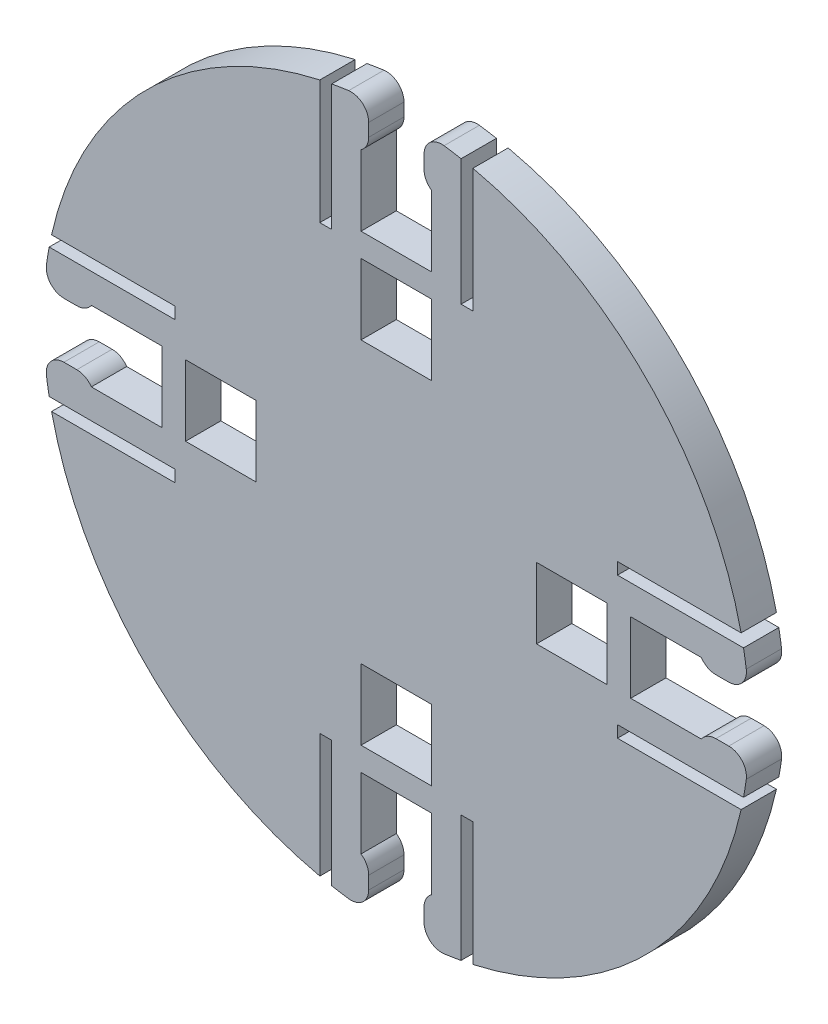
ISO-10303-21;
HEADER;
FILE_DESCRIPTION(('STEP AP214'),'2;1');
FILE_NAME('part.step','',(''),(''),'','','');
FILE_SCHEMA(('AUTOMOTIVE_DESIGN { 1 0 10303 214 1 1 1 1 }'));
ENDSEC;
DATA;
#1=APPLICATION_CONTEXT('core data for automotive mechanical design processes');
#2=APPLICATION_PROTOCOL_DEFINITION('international standard','automotive_design',2000,#1);
#3=PRODUCT_CONTEXT('',#1,'mechanical');
#4=PRODUCT('Part','Part','',(#3));
#5=PRODUCT_RELATED_PRODUCT_CATEGORY('part','',(#4));
#6=PRODUCT_DEFINITION_FORMATION('','',#4);
#7=PRODUCT_DEFINITION_CONTEXT('part definition',#1,'design');
#8=PRODUCT_DEFINITION('design','',#6,#7);
#9=PRODUCT_DEFINITION_SHAPE('','',#8);
#10=(LENGTH_UNIT() NAMED_UNIT(*) SI_UNIT(.MILLI.,.METRE.));
#11=(NAMED_UNIT(*) PLANE_ANGLE_UNIT() SI_UNIT($,.RADIAN.));
#12=(NAMED_UNIT(*) SI_UNIT($,.STERADIAN.) SOLID_ANGLE_UNIT());
#13=UNCERTAINTY_MEASURE_WITH_UNIT(LENGTH_MEASURE(1.E-05),#10,'distance_accuracy_value','');
#14=(GEOMETRIC_REPRESENTATION_CONTEXT(3) GLOBAL_UNCERTAINTY_ASSIGNED_CONTEXT((#13)) GLOBAL_UNIT_ASSIGNED_CONTEXT((#10,
#11,#12)) REPRESENTATION_CONTEXT('',''));
#15=CARTESIAN_POINT('',(0.,0.,0.));
#16=DIRECTION('',(0.,0.,1.));
#17=DIRECTION('',(1.,0.,0.));
#18=AXIS2_PLACEMENT_3D('',#15,#16,#17);
#19=CARTESIAN_POINT('',(0.,-5.50000000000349,3.));
#20=DIRECTION('',(0.,-1.,0.));
#21=DIRECTION('',(0.,0.,-1.));
#22=AXIS2_PLACEMENT_3D('',#19,#20,#21);
#23=PLANE('',#22);
#24=DIRECTION('',(-1.,0.,0.));
#25=VECTOR('',#24,1.);
#26=CARTESIAN_POINT('',(0.,-5.50000000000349,0.));
#27=LINE('',#26,#25);
#28=CARTESIAN_POINT('',(29.4915242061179,-5.50000000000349,0.));
#29=VERTEX_POINT('',#28);
#30=CARTESIAN_POINT('',(18.7873692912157,-5.50000000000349,0.));
#31=VERTEX_POINT('',#30);
#32=EDGE_CURVE('E1051',#29,#31,#27,.T.);
#33=ORIENTED_EDGE('',*,*,#32,.F.);
#34=DIRECTION('',(0.,0.,-1.));
#35=VECTOR('',#34,1.);
#36=CARTESIAN_POINT('',(29.4915242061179,-5.50000000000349,3.));
#37=LINE('',#36,#35);
#38=CARTESIAN_POINT('',(29.4915242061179,-5.50000000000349,3.));
#39=VERTEX_POINT('',#38);
#40=EDGE_CURVE('E617',#39,#29,#37,.T.);
#41=ORIENTED_EDGE('',*,*,#40,.F.);
#42=DIRECTION('',(-1.,0.,0.));
#43=VECTOR('',#42,1.);
#44=CARTESIAN_POINT('',(0.,-5.50000000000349,3.));
#45=LINE('',#44,#43);
#46=CARTESIAN_POINT('',(18.7873692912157,-5.50000000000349,3.));
#47=VERTEX_POINT('',#46);
#48=EDGE_CURVE('E1234',#39,#47,#45,.T.);
#49=ORIENTED_EDGE('',*,*,#48,.T.);
#50=DIRECTION('',(0.,0.,-1.));
#51=VECTOR('',#50,1.);
#52=CARTESIAN_POINT('',(18.7873692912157,-5.50000000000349,3.));
#53=LINE('',#52,#51);
#54=EDGE_CURVE('E854',#47,#31,#53,.T.);
#55=ORIENTED_EDGE('',*,*,#54,.T.);
#56=EDGE_LOOP('',(#33,#41,#49,#55));
#57=FACE_BOUND('',#56,.T.);
#58=ADVANCED_FACE('F35',(#57),#23,.T.);
#59=CARTESIAN_POINT('',(0.,0.,3.));
#60=DIRECTION('',(0.,0.,-1.));
#61=DIRECTION('',(-1.,0.,0.));
#62=AXIS2_PLACEMENT_3D('',#59,#60,#61);
#63=CYLINDRICAL_SURFACE('',#62,30.0000000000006);
#64=CARTESIAN_POINT('',(0.,0.,0.));
#65=DIRECTION('',(0.,0.,1.));
#66=DIRECTION('',(1.,0.,0.));
#67=AXIS2_PLACEMENT_3D('',#64,#65,#66);
#68=CIRCLE('',#67,30.0000000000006);
#69=CARTESIAN_POINT('',(29.7250092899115,-4.05263157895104,0.));
#70=VERTEX_POINT('',#69);
#71=EDGE_CURVE('E1054',#29,#70,#68,.T.);
#72=ORIENTED_EDGE('',*,*,#71,.T.);
#73=DIRECTION('',(0.,0.,-1.));
#74=VECTOR('',#73,1.);
#75=CARTESIAN_POINT('',(29.7250092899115,-4.05263157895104,3.));
#76=LINE('',#75,#74);
#77=CARTESIAN_POINT('',(29.7250092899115,-4.05263157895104,3.));
#78=VERTEX_POINT('',#77);
#79=EDGE_CURVE('E687',#70,#78,#76,.F.);
#80=ORIENTED_EDGE('',*,*,#79,.T.);
#81=CARTESIAN_POINT('',(0.,0.,3.));
#82=DIRECTION('',(0.,0.,1.));
#83=DIRECTION('',(1.,0.,0.));
#84=AXIS2_PLACEMENT_3D('',#81,#82,#83);
#85=CIRCLE('',#84,30.0000000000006);
#86=EDGE_CURVE('E1242',#39,#78,#85,.T.);
#87=ORIENTED_EDGE('',*,*,#86,.F.);
#88=ORIENTED_EDGE('',*,*,#40,.T.);
#89=EDGE_LOOP('',(#72,#80,#87,#88));
#90=FACE_BOUND('',#89,.T.);
#91=ADVANCED_FACE('F1323',(#90),#63,.T.);
#92=CARTESIAN_POINT('',(0.,-2.3500000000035,3.));
#93=DIRECTION('',(0.,-1.,0.));
#94=DIRECTION('',(1.,0.,0.));
#95=AXIS2_PLACEMENT_3D('',#92,#93,#94);
#96=PLANE('',#95);
#97=DIRECTION('',(-1.,0.,0.));
#98=VECTOR('',#97,1.);
#99=CARTESIAN_POINT('',(0.,-2.3500000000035,0.));
#100=LINE('',#99,#98);
#101=CARTESIAN_POINT('',(28.238758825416,-2.35000000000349,0.));
#102=VERTEX_POINT('',#101);
#103=CARTESIAN_POINT('',(27.1437374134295,-2.35000000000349,0.));
#104=VERTEX_POINT('',#103);
#105=EDGE_CURVE('E1057',#102,#104,#100,.T.);
#106=ORIENTED_EDGE('',*,*,#105,.T.);
#107=DIRECTION('',(0.,0.,-1.));
#108=VECTOR('',#107,1.);
#109=CARTESIAN_POINT('',(27.1437374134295,-2.35000000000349,3.));
#110=LINE('',#109,#108);
#111=CARTESIAN_POINT('',(27.1437374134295,-2.35000000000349,3.));
#112=VERTEX_POINT('',#111);
#113=EDGE_CURVE('E685',#104,#112,#110,.F.);
#114=ORIENTED_EDGE('',*,*,#113,.T.);
#115=DIRECTION('',(-1.,0.,0.));
#116=VECTOR('',#115,1.);
#117=CARTESIAN_POINT('',(0.,-2.3500000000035,3.));
#118=LINE('',#117,#116);
#119=CARTESIAN_POINT('',(28.238758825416,-2.35000000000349,3.));
#120=VERTEX_POINT('',#119);
#121=EDGE_CURVE('E1245',#120,#112,#118,.T.);
#122=ORIENTED_EDGE('',*,*,#121,.F.);
#123=DIRECTION('',(0.,0.,-1.));
#124=VECTOR('',#123,1.);
#125=CARTESIAN_POINT('',(28.238758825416,-2.35000000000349,3.));
#126=LINE('',#125,#124);
#127=EDGE_CURVE('E682',#120,#102,#126,.T.);
#128=ORIENTED_EDGE('',*,*,#127,.T.);
#129=EDGE_LOOP('',(#106,#114,#122,#128));
#130=FACE_BOUND('',#129,.T.);
#131=ADVANCED_FACE('F1328',(#130),#96,.F.);
#132=CARTESIAN_POINT('',(0.,-3.00000000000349,3.));
#133=DIRECTION('',(0.,-1.,0.));
#134=DIRECTION('',(0.,0.,-1.));
#135=AXIS2_PLACEMENT_3D('',#132,#133,#134);
#136=PLANE('',#135);
#137=DIRECTION('',(-1.,0.,0.));
#138=VECTOR('',#137,1.);
#139=CARTESIAN_POINT('',(0.,-3.00000000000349,0.));
#140=LINE('',#139,#138);
#141=CARTESIAN_POINT('',(25.9078167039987,-3.00000000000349,0.));
#142=VERTEX_POINT('',#141);
#143=CARTESIAN_POINT('',(19.9078167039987,-3.00000000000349,0.));
#144=VERTEX_POINT('',#143);
#145=EDGE_CURVE('E1060',#142,#144,#140,.T.);
#146=ORIENTED_EDGE('',*,*,#145,.T.);
#147=DIRECTION('',(0.,0.,-1.));
#148=VECTOR('',#147,1.);
#149=CARTESIAN_POINT('',(19.9078167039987,-3.00000000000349,3.));
#150=LINE('',#149,#148);
#151=CARTESIAN_POINT('',(19.9078167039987,-3.00000000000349,3.));
#152=VERTEX_POINT('',#151);
#153=EDGE_CURVE('E967',#152,#144,#150,.T.);
#154=ORIENTED_EDGE('',*,*,#153,.F.);
#155=DIRECTION('',(-1.,0.,0.));
#156=VECTOR('',#155,1.);
#157=CARTESIAN_POINT('',(0.,-3.00000000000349,3.));
#158=LINE('',#157,#156);
#159=CARTESIAN_POINT('',(25.9078167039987,-3.00000000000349,3.));
#160=VERTEX_POINT('',#159);
#161=EDGE_CURVE('E1253',#160,#152,#158,.T.);
#162=ORIENTED_EDGE('',*,*,#161,.F.);
#163=DIRECTION('',(0.,0.,-1.));
#164=VECTOR('',#163,1.);
#165=CARTESIAN_POINT('',(25.9078167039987,-3.00000000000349,3.));
#166=LINE('',#165,#164);
#167=EDGE_CURVE('E969',#160,#142,#166,.T.);
#168=ORIENTED_EDGE('',*,*,#167,.T.);
#169=EDGE_LOOP('',(#146,#154,#162,#168));
#170=FACE_BOUND('',#169,.T.);
#171=ADVANCED_FACE('F1672',(#170),#136,.F.);
#172=CARTESIAN_POINT('',(19.9078167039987,0.,3.));
#173=DIRECTION('',(1.,0.,0.));
#174=DIRECTION('',(0.,0.,-1.));
#175=AXIS2_PLACEMENT_3D('',#172,#173,#174);
#176=PLANE('',#175);
#177=DIRECTION('',(0.,-1.,0.));
#178=VECTOR('',#177,1.);
#179=CARTESIAN_POINT('',(19.9078167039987,0.,0.));
#180=LINE('',#179,#178);
#181=CARTESIAN_POINT('',(19.9078167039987,2.99999999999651,0.));
#182=VERTEX_POINT('',#181);
#183=EDGE_CURVE('E1063',#182,#144,#180,.T.);
#184=ORIENTED_EDGE('',*,*,#183,.F.);
#185=DIRECTION('',(0.,0.,-1.));
#186=VECTOR('',#185,1.);
#187=CARTESIAN_POINT('',(19.9078167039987,2.99999999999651,3.));
#188=LINE('',#187,#186);
#189=CARTESIAN_POINT('',(19.9078167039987,2.99999999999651,3.));
#190=VERTEX_POINT('',#189);
#191=EDGE_CURVE('E965',#190,#182,#188,.T.);
#192=ORIENTED_EDGE('',*,*,#191,.F.);
#193=DIRECTION('',(0.,-1.,0.));
#194=VECTOR('',#193,1.);
#195=CARTESIAN_POINT('',(19.9078167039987,0.,3.));
#196=LINE('',#195,#194);
#197=EDGE_CURVE('E1255',#190,#152,#196,.T.);
#198=ORIENTED_EDGE('',*,*,#197,.T.);
#199=ORIENTED_EDGE('',*,*,#153,.T.);
#200=EDGE_LOOP('',(#184,#192,#198,#199));
#201=FACE_BOUND('',#200,.T.);
#202=ADVANCED_FACE('F1668',(#201),#176,.T.);
#203=CARTESIAN_POINT('',(0.,2.99999999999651,3.));
#204=DIRECTION('',(0.,-1.,0.));
#205=DIRECTION('',(1.,0.,0.));
#206=AXIS2_PLACEMENT_3D('',#203,#204,#205);
#207=PLANE('',#206);
#208=DIRECTION('',(-1.,0.,0.));
#209=VECTOR('',#208,1.);
#210=CARTESIAN_POINT('',(0.,2.99999999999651,0.));
#211=LINE('',#210,#209);
#212=CARTESIAN_POINT('',(25.9078167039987,2.99999999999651,0.));
#213=VERTEX_POINT('',#212);
#214=EDGE_CURVE('E1066',#213,#182,#211,.T.);
#215=ORIENTED_EDGE('',*,*,#214,.F.);
#216=DIRECTION('',(0.,0.,-1.));
#217=VECTOR('',#216,1.);
#218=CARTESIAN_POINT('',(25.9078167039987,2.99999999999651,3.));
#219=LINE('',#218,#217);
#220=CARTESIAN_POINT('',(25.9078167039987,2.99999999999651,3.));
#221=VERTEX_POINT('',#220);
#222=EDGE_CURVE('E962',#221,#213,#219,.T.);
#223=ORIENTED_EDGE('',*,*,#222,.F.);
#224=DIRECTION('',(-1.,0.,0.));
#225=VECTOR('',#224,1.);
#226=CARTESIAN_POINT('',(0.,2.99999999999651,3.));
#227=LINE('',#226,#225);
#228=EDGE_CURVE('E1258',#221,#190,#227,.T.);
#229=ORIENTED_EDGE('',*,*,#228,.T.);
#230=ORIENTED_EDGE('',*,*,#191,.T.);
#231=EDGE_LOOP('',(#215,#223,#229,#230));
#232=FACE_BOUND('',#231,.T.);
#233=ADVANCED_FACE('F1664',(#232),#207,.T.);
#234=CARTESIAN_POINT('',(0.,2.34999999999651,3.));
#235=DIRECTION('',(0.,-1.,0.));
#236=DIRECTION('',(1.,0.,0.));
#237=AXIS2_PLACEMENT_3D('',#234,#235,#236);
#238=PLANE('',#237);
#239=DIRECTION('',(-1.,0.,0.));
#240=VECTOR('',#239,1.);
#241=CARTESIAN_POINT('',(0.,2.34999999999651,3.));
#242=LINE('',#241,#240);
#243=CARTESIAN_POINT('',(28.238758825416,2.34999999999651,3.));
#244=VERTEX_POINT('',#243);
#245=CARTESIAN_POINT('',(27.1437374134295,2.34999999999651,3.));
#246=VERTEX_POINT('',#245);
#247=EDGE_CURVE('E1261',#244,#246,#242,.T.);
#248=ORIENTED_EDGE('',*,*,#247,.T.);
#249=DIRECTION('',(0.,0.,1.));
#250=VECTOR('',#249,1.);
#251=CARTESIAN_POINT('',(27.1437374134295,2.34999999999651,0.));
#252=LINE('',#251,#250);
#253=CARTESIAN_POINT('',(27.1437374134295,2.34999999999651,0.));
#254=VERTEX_POINT('',#253);
#255=EDGE_CURVE('E616',#246,#254,#252,.F.);
#256=ORIENTED_EDGE('',*,*,#255,.T.);
#257=DIRECTION('',(-1.,0.,0.));
#258=VECTOR('',#257,1.);
#259=CARTESIAN_POINT('',(0.,2.34999999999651,0.));
#260=LINE('',#259,#258);
#261=CARTESIAN_POINT('',(28.238758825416,2.34999999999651,0.));
#262=VERTEX_POINT('',#261);
#263=EDGE_CURVE('E1069',#262,#254,#260,.T.);
#264=ORIENTED_EDGE('',*,*,#263,.F.);
#265=DIRECTION('',(0.,0.,1.));
#266=VECTOR('',#265,1.);
#267=CARTESIAN_POINT('',(28.238758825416,2.34999999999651,3.));
#268=LINE('',#267,#266);
#269=EDGE_CURVE('E614',#262,#244,#268,.T.);
#270=ORIENTED_EDGE('',*,*,#269,.T.);
#271=EDGE_LOOP('',(#248,#256,#264,#270));
#272=FACE_BOUND('',#271,.T.);
#273=ADVANCED_FACE('F1660',(#272),#238,.T.);
#274=CARTESIAN_POINT('',(0.,0.,3.));
#275=DIRECTION('',(0.,0.,-1.));
#276=DIRECTION('',(-1.,0.,0.));
#277=AXIS2_PLACEMENT_3D('',#274,#275,#276);
#278=CYLINDRICAL_SURFACE('',#277,29.9999999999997);
#279=CARTESIAN_POINT('',(0.,0.,3.));
#280=DIRECTION('',(0.,0.,1.));
#281=DIRECTION('',(1.,0.,0.));
#282=AXIS2_PLACEMENT_3D('',#279,#280,#281);
#283=CIRCLE('',#282,29.9999999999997);
#284=CARTESIAN_POINT('',(29.7250092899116,4.0526315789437,3.));
#285=VERTEX_POINT('',#284);
#286=CARTESIAN_POINT('',(29.4915242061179,5.49999999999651,3.));
#287=VERTEX_POINT('',#286);
#288=EDGE_CURVE('E1264',#285,#287,#283,.T.);
#289=ORIENTED_EDGE('',*,*,#288,.F.);
#290=DIRECTION('',(0.,0.,-1.));
#291=VECTOR('',#290,1.);
#292=CARTESIAN_POINT('',(29.7250092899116,4.0526315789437,3.));
#293=LINE('',#292,#291);
#294=CARTESIAN_POINT('',(29.7250092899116,4.0526315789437,0.));
#295=VERTEX_POINT('',#294);
#296=EDGE_CURVE('E689',#285,#295,#293,.T.);
#297=ORIENTED_EDGE('',*,*,#296,.T.);
#298=CARTESIAN_POINT('',(0.,0.,0.));
#299=DIRECTION('',(0.,0.,1.));
#300=DIRECTION('',(1.,0.,0.));
#301=AXIS2_PLACEMENT_3D('',#298,#299,#300);
#302=CIRCLE('',#301,29.9999999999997);
#303=CARTESIAN_POINT('',(29.4915242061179,5.49999999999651,0.));
#304=VERTEX_POINT('',#303);
#305=EDGE_CURVE('E1071',#295,#304,#302,.T.);
#306=ORIENTED_EDGE('',*,*,#305,.T.);
#307=DIRECTION('',(0.,0.,-1.));
#308=VECTOR('',#307,1.);
#309=CARTESIAN_POINT('',(29.4915242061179,5.49999999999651,3.));
#310=LINE('',#309,#308);
#311=EDGE_CURVE('E959',#287,#304,#310,.T.);
#312=ORIENTED_EDGE('',*,*,#311,.F.);
#313=EDGE_LOOP('',(#289,#297,#306,#312));
#314=FACE_BOUND('',#313,.T.);
#315=ADVANCED_FACE('F1656',(#314),#278,.T.);
#316=CARTESIAN_POINT('',(0.,5.4999999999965,3.));
#317=DIRECTION('',(0.,-1.,0.));
#318=DIRECTION('',(1.,0.,0.));
#319=AXIS2_PLACEMENT_3D('',#316,#317,#318);
#320=PLANE('',#319);
#321=DIRECTION('',(-1.,0.,0.));
#322=VECTOR('',#321,1.);
#323=CARTESIAN_POINT('',(0.,5.4999999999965,0.));
#324=LINE('',#323,#322);
#325=CARTESIAN_POINT('',(18.7873692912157,5.49999999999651,0.));
#326=VERTEX_POINT('',#325);
#327=EDGE_CURVE('E1073',#304,#326,#324,.T.);
#328=ORIENTED_EDGE('',*,*,#327,.T.);
#329=DIRECTION('',(0.,0.,-1.));
#330=VECTOR('',#329,1.);
#331=CARTESIAN_POINT('',(18.7873692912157,5.49999999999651,3.));
#332=LINE('',#331,#330);
#333=CARTESIAN_POINT('',(18.7873692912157,5.49999999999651,3.));
#334=VERTEX_POINT('',#333);
#335=EDGE_CURVE('E956',#334,#326,#332,.T.);
#336=ORIENTED_EDGE('',*,*,#335,.F.);
#337=DIRECTION('',(-1.,0.,0.));
#338=VECTOR('',#337,1.);
#339=CARTESIAN_POINT('',(0.,5.4999999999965,3.));
#340=LINE('',#339,#338);
#341=EDGE_CURVE('E1266',#287,#334,#340,.T.);
#342=ORIENTED_EDGE('',*,*,#341,.F.);
#343=ORIENTED_EDGE('',*,*,#311,.T.);
#344=EDGE_LOOP('',(#328,#336,#342,#343));
#345=FACE_BOUND('',#344,.T.);
#346=ADVANCED_FACE('F1652',(#345),#320,.F.);
#347=CARTESIAN_POINT('',(18.7873692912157,0.,3.));
#348=DIRECTION('',(-1.,0.,0.));
#349=DIRECTION('',(0.,0.,1.));
#350=AXIS2_PLACEMENT_3D('',#347,#348,#349);
#351=PLANE('',#350);
#352=DIRECTION('',(0.,1.,0.));
#353=VECTOR('',#352,1.);
#354=CARTESIAN_POINT('',(18.7873692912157,0.,0.));
#355=LINE('',#354,#353);
#356=CARTESIAN_POINT('',(18.7873692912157,6.49999999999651,0.));
#357=VERTEX_POINT('',#356);
#358=EDGE_CURVE('E1076',#326,#357,#355,.T.);
#359=ORIENTED_EDGE('',*,*,#358,.T.);
#360=DIRECTION('',(0.,0.,-1.));
#361=VECTOR('',#360,1.);
#362=CARTESIAN_POINT('',(18.7873692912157,6.49999999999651,3.));
#363=LINE('',#362,#361);
#364=CARTESIAN_POINT('',(18.7873692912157,6.49999999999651,3.));
#365=VERTEX_POINT('',#364);
#366=EDGE_CURVE('E953',#365,#357,#363,.T.);
#367=ORIENTED_EDGE('',*,*,#366,.F.);
#368=DIRECTION('',(0.,1.,0.));
#369=VECTOR('',#368,1.);
#370=CARTESIAN_POINT('',(18.7873692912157,0.,3.));
#371=LINE('',#370,#369);
#372=EDGE_CURVE('E1269',#334,#365,#371,.T.);
#373=ORIENTED_EDGE('',*,*,#372,.F.);
#374=ORIENTED_EDGE('',*,*,#335,.T.);
#375=EDGE_LOOP('',(#359,#367,#373,#374));
#376=FACE_BOUND('',#375,.T.);
#377=ADVANCED_FACE('F1648',(#376),#351,.F.);
#378=CARTESIAN_POINT('',(0.,6.49999999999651,3.));
#379=DIRECTION('',(0.,1.,0.));
#380=DIRECTION('',(-1.,0.,0.));
#381=AXIS2_PLACEMENT_3D('',#378,#379,#380);
#382=PLANE('',#381);
#383=DIRECTION('',(1.,0.,0.));
#384=VECTOR('',#383,1.);
#385=CARTESIAN_POINT('',(0.,6.49999999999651,0.));
#386=LINE('',#385,#384);
#387=CARTESIAN_POINT('',(29.2873692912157,6.49999999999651,0.));
#388=VERTEX_POINT('',#387);
#389=EDGE_CURVE('E1079',#357,#388,#386,.T.);
#390=ORIENTED_EDGE('',*,*,#389,.T.);
#391=DIRECTION('',(0.,0.,-1.));
#392=VECTOR('',#391,1.);
#393=CARTESIAN_POINT('',(29.2873692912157,6.49999999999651,3.));
#394=LINE('',#393,#392);
#395=CARTESIAN_POINT('',(29.2873692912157,6.49999999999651,3.));
#396=VERTEX_POINT('',#395);
#397=EDGE_CURVE('E950',#396,#388,#394,.T.);
#398=ORIENTED_EDGE('',*,*,#397,.F.);
#399=DIRECTION('',(1.,0.,0.));
#400=VECTOR('',#399,1.);
#401=CARTESIAN_POINT('',(0.,6.49999999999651,3.));
#402=LINE('',#401,#400);
#403=EDGE_CURVE('E1272',#365,#396,#402,.T.);
#404=ORIENTED_EDGE('',*,*,#403,.F.);
#405=ORIENTED_EDGE('',*,*,#366,.T.);
#406=EDGE_LOOP('',(#390,#398,#404,#405));
#407=FACE_BOUND('',#406,.T.);
#408=ADVANCED_FACE('F1644',(#407),#382,.F.);
#409=CARTESIAN_POINT('',(0.,0.,3.));
#410=DIRECTION('',(0.,0.,-1.));
#411=DIRECTION('',(-1.,0.,0.));
#412=AXIS2_PLACEMENT_3D('',#409,#410,#411);
#413=CYLINDRICAL_SURFACE('',#412,30.0000000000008);
#414=CARTESIAN_POINT('',(0.,0.,0.));
#415=DIRECTION('',(0.,0.,1.));
#416=DIRECTION('',(1.,0.,0.));
#417=AXIS2_PLACEMENT_3D('',#414,#415,#416);
#418=CIRCLE('',#417,30.0000000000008);
#419=CARTESIAN_POINT('',(6.50000000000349,29.2873692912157,0.));
#420=VERTEX_POINT('',#419);
#421=EDGE_CURVE('E1082',#388,#420,#418,.T.);
#422=ORIENTED_EDGE('',*,*,#421,.T.);
#423=DIRECTION('',(0.,0.,-1.));
#424=VECTOR('',#423,1.);
#425=CARTESIAN_POINT('',(6.50000000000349,29.2873692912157,3.));
#426=LINE('',#425,#424);
#427=CARTESIAN_POINT('',(6.50000000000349,29.2873692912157,3.));
#428=VERTEX_POINT('',#427);
#429=EDGE_CURVE('E948',#428,#420,#426,.T.);
#430=ORIENTED_EDGE('',*,*,#429,.F.);
#431=CARTESIAN_POINT('',(0.,0.,3.));
#432=DIRECTION('',(0.,0.,1.));
#433=DIRECTION('',(1.,0.,0.));
#434=AXIS2_PLACEMENT_3D('',#431,#432,#433);
#435=CIRCLE('',#434,30.0000000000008);
#436=EDGE_CURVE('E1275',#396,#428,#435,.T.);
#437=ORIENTED_EDGE('',*,*,#436,.F.);
#438=ORIENTED_EDGE('',*,*,#397,.T.);
#439=EDGE_LOOP('',(#422,#430,#437,#438));
#440=FACE_BOUND('',#439,.T.);
#441=ADVANCED_FACE('F1640',(#440),#413,.T.);
#442=CARTESIAN_POINT('',(6.50000000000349,0.,3.));
#443=DIRECTION('',(-1.,0.,0.));
#444=DIRECTION('',(0.,0.,1.));
#445=AXIS2_PLACEMENT_3D('',#442,#443,#444);
#446=PLANE('',#445);
#447=DIRECTION('',(0.,1.,0.));
#448=VECTOR('',#447,1.);
#449=CARTESIAN_POINT('',(6.50000000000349,0.,0.));
#450=LINE('',#449,#448);
#451=CARTESIAN_POINT('',(6.50000000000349,18.7873692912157,0.));
#452=VERTEX_POINT('',#451);
#453=EDGE_CURVE('E1085',#452,#420,#450,.T.);
#454=ORIENTED_EDGE('',*,*,#453,.F.);
#455=DIRECTION('',(0.,0.,-1.));
#456=VECTOR('',#455,1.);
#457=CARTESIAN_POINT('',(6.50000000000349,18.7873692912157,3.));
#458=LINE('',#457,#456);
#459=CARTESIAN_POINT('',(6.50000000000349,18.7873692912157,3.));
#460=VERTEX_POINT('',#459);
#461=EDGE_CURVE('E946',#460,#452,#458,.T.);
#462=ORIENTED_EDGE('',*,*,#461,.F.);
#463=DIRECTION('',(0.,1.,0.));
#464=VECTOR('',#463,1.);
#465=CARTESIAN_POINT('',(6.50000000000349,0.,3.));
#466=LINE('',#465,#464);
#467=EDGE_CURVE('E1277',#460,#428,#466,.T.);
#468=ORIENTED_EDGE('',*,*,#467,.T.);
#469=ORIENTED_EDGE('',*,*,#429,.T.);
#470=EDGE_LOOP('',(#454,#462,#468,#469));
#471=FACE_BOUND('',#470,.T.);
#472=ADVANCED_FACE('F1636',(#471),#446,.T.);
#473=CARTESIAN_POINT('',(0.,18.7873692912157,3.));
#474=DIRECTION('',(0.,1.,0.));
#475=DIRECTION('',(0.,0.,1.));
#476=AXIS2_PLACEMENT_3D('',#473,#474,#475);
#477=PLANE('',#476);
#478=DIRECTION('',(1.,0.,0.));
#479=VECTOR('',#478,1.);
#480=CARTESIAN_POINT('',(0.,18.7873692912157,0.));
#481=LINE('',#480,#479);
#482=CARTESIAN_POINT('',(5.50000000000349,18.7873692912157,0.));
#483=VERTEX_POINT('',#482);
#484=EDGE_CURVE('E1088',#483,#452,#481,.T.);
#485=ORIENTED_EDGE('',*,*,#484,.F.);
#486=DIRECTION('',(0.,0.,-1.));
#487=VECTOR('',#486,1.);
#488=CARTESIAN_POINT('',(5.50000000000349,18.7873692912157,3.));
#489=LINE('',#488,#487);
#490=CARTESIAN_POINT('',(5.50000000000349,18.7873692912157,3.));
#491=VERTEX_POINT('',#490);
#492=EDGE_CURVE('E944',#491,#483,#489,.T.);
#493=ORIENTED_EDGE('',*,*,#492,.F.);
#494=DIRECTION('',(1.,0.,0.));
#495=VECTOR('',#494,1.);
#496=CARTESIAN_POINT('',(0.,18.7873692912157,3.));
#497=LINE('',#496,#495);
#498=EDGE_CURVE('E1280',#491,#460,#497,.T.);
#499=ORIENTED_EDGE('',*,*,#498,.T.);
#500=ORIENTED_EDGE('',*,*,#461,.T.);
#501=EDGE_LOOP('',(#485,#493,#499,#500));
#502=FACE_BOUND('',#501,.T.);
#503=ADVANCED_FACE('F1632',(#502),#477,.T.);
#504=CARTESIAN_POINT('',(5.50000000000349,0.,3.));
#505=DIRECTION('',(1.,0.,0.));
#506=DIRECTION('',(0.,1.,0.));
#507=AXIS2_PLACEMENT_3D('',#504,#505,#506);
#508=PLANE('',#507);
#509=DIRECTION('',(0.,-1.,0.));
#510=VECTOR('',#509,1.);
#511=CARTESIAN_POINT('',(5.50000000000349,0.,0.));
#512=LINE('',#511,#510);
#513=CARTESIAN_POINT('',(5.50000000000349,29.4915242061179,0.));
#514=VERTEX_POINT('',#513);
#515=EDGE_CURVE('E1091',#514,#483,#512,.T.);
#516=ORIENTED_EDGE('',*,*,#515,.F.);
#517=DIRECTION('',(0.,0.,-1.));
#518=VECTOR('',#517,1.);
#519=CARTESIAN_POINT('',(5.50000000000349,29.4915242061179,3.));
#520=LINE('',#519,#518);
#521=CARTESIAN_POINT('',(5.50000000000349,29.4915242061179,3.));
#522=VERTEX_POINT('',#521);
#523=EDGE_CURVE('E942',#522,#514,#520,.T.);
#524=ORIENTED_EDGE('',*,*,#523,.F.);
#525=DIRECTION('',(0.,-1.,0.));
#526=VECTOR('',#525,1.);
#527=CARTESIAN_POINT('',(5.50000000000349,0.,3.));
#528=LINE('',#527,#526);
#529=EDGE_CURVE('E1283',#522,#491,#528,.T.);
#530=ORIENTED_EDGE('',*,*,#529,.T.);
#531=ORIENTED_EDGE('',*,*,#492,.T.);
#532=EDGE_LOOP('',(#516,#524,#530,#531));
#533=FACE_BOUND('',#532,.T.);
#534=ADVANCED_FACE('F1628',(#533),#508,.T.);
#535=CARTESIAN_POINT('',(0.,0.,3.));
#536=DIRECTION('',(0.,0.,-1.));
#537=DIRECTION('',(-1.,0.,0.));
#538=AXIS2_PLACEMENT_3D('',#535,#536,#537);
#539=CYLINDRICAL_SURFACE('',#538,30.0000000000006);
#540=CARTESIAN_POINT('',(0.,0.,0.));
#541=DIRECTION('',(0.,0.,1.));
#542=DIRECTION('',(1.,0.,0.));
#543=AXIS2_PLACEMENT_3D('',#540,#541,#542);
#544=CIRCLE('',#543,30.0000000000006);
#545=CARTESIAN_POINT('',(4.05263157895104,29.7250092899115,0.));
#546=VERTEX_POINT('',#545);
#547=EDGE_CURVE('E1094',#514,#546,#544,.T.);
#548=ORIENTED_EDGE('',*,*,#547,.T.);
#549=DIRECTION('',(0.,0.,-1.));
#550=VECTOR('',#549,1.);
#551=CARTESIAN_POINT('',(4.05263157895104,29.7250092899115,3.));
#552=LINE('',#551,#550);
#553=CARTESIAN_POINT('',(4.05263157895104,29.7250092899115,3.));
#554=VERTEX_POINT('',#553);
#555=EDGE_CURVE('E11',#546,#554,#552,.F.);
#556=ORIENTED_EDGE('',*,*,#555,.T.);
#557=CARTESIAN_POINT('',(0.,0.,3.));
#558=DIRECTION('',(0.,0.,1.));
#559=DIRECTION('',(1.,0.,0.));
#560=AXIS2_PLACEMENT_3D('',#557,#558,#559);
#561=CIRCLE('',#560,30.0000000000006);
#562=EDGE_CURVE('E1286',#522,#554,#561,.T.);
#563=ORIENTED_EDGE('',*,*,#562,.F.);
#564=ORIENTED_EDGE('',*,*,#523,.T.);
#565=EDGE_LOOP('',(#548,#556,#563,#564));
#566=FACE_BOUND('',#565,.T.);
#567=ADVANCED_FACE('F1625',(#566),#539,.T.);
#568=CARTESIAN_POINT('',(2.35000000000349,0.,3.));
#569=DIRECTION('',(1.,0.,0.));
#570=DIRECTION('',(0.,1.,0.));
#571=AXIS2_PLACEMENT_3D('',#568,#569,#570);
#572=PLANE('',#571);
#573=DIRECTION('',(0.,-1.,0.));
#574=VECTOR('',#573,1.);
#575=CARTESIAN_POINT('',(2.35000000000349,0.,0.));
#576=LINE('',#575,#574);
#577=CARTESIAN_POINT('',(2.35000000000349,28.238758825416,0.));
#578=VERTEX_POINT('',#577);
#579=CARTESIAN_POINT('',(2.35000000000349,27.1437374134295,0.));
#580=VERTEX_POINT('',#579);
#581=EDGE_CURVE('E1097',#578,#580,#576,.T.);
#582=ORIENTED_EDGE('',*,*,#581,.T.);
#583=DIRECTION('',(0.,0.,-1.));
#584=VECTOR('',#583,1.);
#585=CARTESIAN_POINT('',(2.35000000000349,27.1437374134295,3.));
#586=LINE('',#585,#584);
#587=CARTESIAN_POINT('',(2.35000000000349,27.1437374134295,3.));
#588=VERTEX_POINT('',#587);
#589=EDGE_CURVE('E725',#580,#588,#586,.F.);
#590=ORIENTED_EDGE('',*,*,#589,.T.);
#591=DIRECTION('',(0.,-1.,0.));
#592=VECTOR('',#591,1.);
#593=CARTESIAN_POINT('',(2.35000000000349,0.,3.));
#594=LINE('',#593,#592);
#595=CARTESIAN_POINT('',(2.35000000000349,28.238758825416,3.));
#596=VERTEX_POINT('',#595);
#597=EDGE_CURVE('E1289',#596,#588,#594,.T.);
#598=ORIENTED_EDGE('',*,*,#597,.F.);
#599=DIRECTION('',(0.,0.,-1.));
#600=VECTOR('',#599,1.);
#601=CARTESIAN_POINT('',(2.35000000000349,28.238758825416,3.));
#602=LINE('',#601,#600);
#603=EDGE_CURVE('E722',#596,#578,#602,.T.);
#604=ORIENTED_EDGE('',*,*,#603,.T.);
#605=EDGE_LOOP('',(#582,#590,#598,#604));
#606=FACE_BOUND('',#605,.T.);
#607=ADVANCED_FACE('F1306',(#606),#572,.F.);
#608=CARTESIAN_POINT('',(3.00000000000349,0.,3.));
#609=DIRECTION('',(1.,0.,0.));
#610=DIRECTION('',(0.,1.,0.));
#611=AXIS2_PLACEMENT_3D('',#608,#609,#610);
#612=PLANE('',#611);
#613=DIRECTION('',(0.,-1.,0.));
#614=VECTOR('',#613,1.);
#615=CARTESIAN_POINT('',(3.00000000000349,0.,0.));
#616=LINE('',#615,#614);
#617=CARTESIAN_POINT('',(3.00000000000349,25.9078167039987,0.));
#618=VERTEX_POINT('',#617);
#619=CARTESIAN_POINT('',(3.00000000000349,19.9078167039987,0.));
#620=VERTEX_POINT('',#619);
#621=EDGE_CURVE('E1100',#618,#620,#616,.T.);
#622=ORIENTED_EDGE('',*,*,#621,.T.);
#623=DIRECTION('',(0.,0.,-1.));
#624=VECTOR('',#623,1.);
#625=CARTESIAN_POINT('',(3.00000000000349,19.9078167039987,3.));
#626=LINE('',#625,#624);
#627=CARTESIAN_POINT('',(3.00000000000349,19.9078167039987,3.));
#628=VERTEX_POINT('',#627);
#629=EDGE_CURVE('E937',#628,#620,#626,.T.);
#630=ORIENTED_EDGE('',*,*,#629,.F.);
#631=DIRECTION('',(0.,-1.,0.));
#632=VECTOR('',#631,1.);
#633=CARTESIAN_POINT('',(3.00000000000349,0.,3.));
#634=LINE('',#633,#632);
#635=CARTESIAN_POINT('',(3.00000000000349,25.9078167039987,3.));
#636=VERTEX_POINT('',#635);
#637=EDGE_CURVE('E1292',#636,#628,#634,.T.);
#638=ORIENTED_EDGE('',*,*,#637,.F.);
#639=DIRECTION('',(0.,0.,-1.));
#640=VECTOR('',#639,1.);
#641=CARTESIAN_POINT('',(3.00000000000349,25.9078167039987,3.));
#642=LINE('',#641,#640);
#643=EDGE_CURVE('E939',#636,#618,#642,.T.);
#644=ORIENTED_EDGE('',*,*,#643,.T.);
#645=EDGE_LOOP('',(#622,#630,#638,#644));
#646=FACE_BOUND('',#645,.T.);
#647=ADVANCED_FACE('F1301',(#646),#612,.F.);
#648=CARTESIAN_POINT('',(0.,19.9078167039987,3.));
#649=DIRECTION('',(0.,1.,0.));
#650=DIRECTION('',(0.,0.,1.));
#651=AXIS2_PLACEMENT_3D('',#648,#649,#650);
#652=PLANE('',#651);
#653=DIRECTION('',(1.,0.,0.));
#654=VECTOR('',#653,1.);
#655=CARTESIAN_POINT('',(0.,19.9078167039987,0.));
#656=LINE('',#655,#654);
#657=CARTESIAN_POINT('',(-2.99999999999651,19.9078167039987,0.));
#658=VERTEX_POINT('',#657);
#659=EDGE_CURVE('E1103',#658,#620,#656,.T.);
#660=ORIENTED_EDGE('',*,*,#659,.F.);
#661=DIRECTION('',(0.,0.,-1.));
#662=VECTOR('',#661,1.);
#663=CARTESIAN_POINT('',(-2.99999999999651,19.9078167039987,3.));
#664=LINE('',#663,#662);
#665=CARTESIAN_POINT('',(-2.99999999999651,19.9078167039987,3.));
#666=VERTEX_POINT('',#665);
#667=EDGE_CURVE('E935',#666,#658,#664,.T.);
#668=ORIENTED_EDGE('',*,*,#667,.F.);
#669=DIRECTION('',(1.,0.,0.));
#670=VECTOR('',#669,1.);
#671=CARTESIAN_POINT('',(0.,19.9078167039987,3.));
#672=LINE('',#671,#670);
#673=EDGE_CURVE('E1129',#666,#628,#672,.T.);
#674=ORIENTED_EDGE('',*,*,#673,.T.);
#675=ORIENTED_EDGE('',*,*,#629,.T.);
#676=EDGE_LOOP('',(#660,#668,#674,#675));
#677=FACE_BOUND('',#676,.T.);
#678=ADVANCED_FACE('F1295',(#677),#652,.T.);
#679=CARTESIAN_POINT('',(-2.99999999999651,0.,3.));
#680=DIRECTION('',(1.,0.,0.));
#681=DIRECTION('',(0.,1.,0.));
#682=AXIS2_PLACEMENT_3D('',#679,#680,#681);
#683=PLANE('',#682);
#684=DIRECTION('',(0.,-1.,0.));
#685=VECTOR('',#684,1.);
#686=CARTESIAN_POINT('',(-2.99999999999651,0.,0.));
#687=LINE('',#686,#685);
#688=CARTESIAN_POINT('',(-2.99999999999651,25.9078167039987,0.));
#689=VERTEX_POINT('',#688);
#690=EDGE_CURVE('E755',#689,#658,#687,.T.);
#691=ORIENTED_EDGE('',*,*,#690,.F.);
#692=DIRECTION('',(0.,0.,-1.));
#693=VECTOR('',#692,1.);
#694=CARTESIAN_POINT('',(-2.99999999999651,25.9078167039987,3.));
#695=LINE('',#694,#693);
#696=CARTESIAN_POINT('',(-2.99999999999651,25.9078167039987,3.));
#697=VERTEX_POINT('',#696);
#698=EDGE_CURVE('E932',#697,#689,#695,.T.);
#699=ORIENTED_EDGE('',*,*,#698,.F.);
#700=DIRECTION('',(0.,-1.,0.));
#701=VECTOR('',#700,1.);
#702=CARTESIAN_POINT('',(-2.99999999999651,0.,3.));
#703=LINE('',#702,#701);
#704=EDGE_CURVE('E1122',#697,#666,#703,.T.);
#705=ORIENTED_EDGE('',*,*,#704,.T.);
#706=ORIENTED_EDGE('',*,*,#667,.T.);
#707=EDGE_LOOP('',(#691,#699,#705,#706));
#708=FACE_BOUND('',#707,.T.);
#709=ADVANCED_FACE('F1110',(#708),#683,.T.);
#710=CARTESIAN_POINT('',(-2.34999999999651,0.,3.));
#711=DIRECTION('',(1.,0.,0.));
#712=DIRECTION('',(0.,1.,0.));
#713=AXIS2_PLACEMENT_3D('',#710,#711,#712);
#714=PLANE('',#713);
#715=DIRECTION('',(0.,-1.,0.));
#716=VECTOR('',#715,1.);
#717=CARTESIAN_POINT('',(-2.34999999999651,0.,3.));
#718=LINE('',#717,#716);
#719=CARTESIAN_POINT('',(-2.34999999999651,28.238758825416,3.));
#720=VERTEX_POINT('',#719);
#721=CARTESIAN_POINT('',(-2.34999999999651,27.1437374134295,3.));
#722=VERTEX_POINT('',#721);
#723=EDGE_CURVE('E1120',#720,#722,#718,.T.);
#724=ORIENTED_EDGE('',*,*,#723,.T.);
#725=DIRECTION('',(0.,0.,1.));
#726=VECTOR('',#725,1.);
#727=CARTESIAN_POINT('',(-2.34999999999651,27.1437374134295,0.));
#728=LINE('',#727,#726);
#729=CARTESIAN_POINT('',(-2.34999999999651,27.1437374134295,0.));
#730=VERTEX_POINT('',#729);
#731=EDGE_CURVE('E729',#722,#730,#728,.F.);
#732=ORIENTED_EDGE('',*,*,#731,.T.);
#733=DIRECTION('',(0.,-1.,0.));
#734=VECTOR('',#733,1.);
#735=CARTESIAN_POINT('',(-2.34999999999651,0.,0.));
#736=LINE('',#735,#734);
#737=CARTESIAN_POINT('',(-2.34999999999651,28.238758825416,0.));
#738=VERTEX_POINT('',#737);
#739=EDGE_CURVE('E751',#738,#730,#736,.T.);
#740=ORIENTED_EDGE('',*,*,#739,.F.);
#741=DIRECTION('',(0.,0.,1.));
#742=VECTOR('',#741,1.);
#743=CARTESIAN_POINT('',(-2.34999999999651,28.238758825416,3.));
#744=LINE('',#743,#742);
#745=EDGE_CURVE('E727',#738,#720,#744,.T.);
#746=ORIENTED_EDGE('',*,*,#745,.T.);
#747=EDGE_LOOP('',(#724,#732,#740,#746));
#748=FACE_BOUND('',#747,.T.);
#749=ADVANCED_FACE('F1124',(#748),#714,.T.);
#750=CARTESIAN_POINT('',(0.,0.,3.));
#751=DIRECTION('',(0.,0.,-1.));
#752=DIRECTION('',(-1.,0.,0.));
#753=AXIS2_PLACEMENT_3D('',#750,#751,#752);
#754=CYLINDRICAL_SURFACE('',#753,29.9999999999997);
#755=CARTESIAN_POINT('',(0.,0.,3.));
#756=DIRECTION('',(0.,0.,1.));
#757=DIRECTION('',(1.,0.,0.));
#758=AXIS2_PLACEMENT_3D('',#755,#756,#757);
#759=CIRCLE('',#758,29.9999999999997);
#760=CARTESIAN_POINT('',(-4.0526315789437,29.7250092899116,3.));
#761=VERTEX_POINT('',#760);
#762=CARTESIAN_POINT('',(-5.49999999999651,29.4915242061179,3.));
#763=VERTEX_POINT('',#762);
#764=EDGE_CURVE('E740',#761,#763,#759,.T.);
#765=ORIENTED_EDGE('',*,*,#764,.F.);
#766=DIRECTION('',(0.,0.,-1.));
#767=VECTOR('',#766,1.);
#768=CARTESIAN_POINT('',(-4.0526315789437,29.7250092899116,3.));
#769=LINE('',#768,#767);
#770=CARTESIAN_POINT('',(-4.0526315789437,29.7250092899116,0.));
#771=VERTEX_POINT('',#770);
#772=EDGE_CURVE('E43',#761,#771,#769,.T.);
#773=ORIENTED_EDGE('',*,*,#772,.T.);
#774=CARTESIAN_POINT('',(0.,0.,0.));
#775=DIRECTION('',(0.,0.,1.));
#776=DIRECTION('',(1.,0.,0.));
#777=AXIS2_PLACEMENT_3D('',#774,#775,#776);
#778=CIRCLE('',#777,29.9999999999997);
#779=CARTESIAN_POINT('',(-5.49999999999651,29.4915242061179,0.));
#780=VERTEX_POINT('',#779);
#781=EDGE_CURVE('E738',#771,#780,#778,.T.);
#782=ORIENTED_EDGE('',*,*,#781,.T.);
#783=DIRECTION('',(0.,0.,-1.));
#784=VECTOR('',#783,1.);
#785=CARTESIAN_POINT('',(-5.49999999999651,29.4915242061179,3.));
#786=LINE('',#785,#784);
#787=EDGE_CURVE('E930',#763,#780,#786,.T.);
#788=ORIENTED_EDGE('',*,*,#787,.F.);
#789=EDGE_LOOP('',(#765,#773,#782,#788));
#790=FACE_BOUND('',#789,.T.);
#791=ADVANCED_FACE('F736',(#790),#754,.T.);
#792=CARTESIAN_POINT('',(-5.49999999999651,0.,3.));
#793=DIRECTION('',(1.,0.,0.));
#794=DIRECTION('',(0.,1.,0.));
#795=AXIS2_PLACEMENT_3D('',#792,#793,#794);
#796=PLANE('',#795);
#797=DIRECTION('',(0.,-1.,0.));
#798=VECTOR('',#797,1.);
#799=CARTESIAN_POINT('',(-5.49999999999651,0.,0.));
#800=LINE('',#799,#798);
#801=CARTESIAN_POINT('',(-5.49999999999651,18.7873692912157,0.));
#802=VERTEX_POINT('',#801);
#803=EDGE_CURVE('E749',#780,#802,#800,.T.);
#804=ORIENTED_EDGE('',*,*,#803,.T.);
#805=DIRECTION('',(0.,0.,-1.));
#806=VECTOR('',#805,1.);
#807=CARTESIAN_POINT('',(-5.49999999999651,18.7873692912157,3.));
#808=LINE('',#807,#806);
#809=CARTESIAN_POINT('',(-5.49999999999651,18.7873692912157,3.));
#810=VERTEX_POINT('',#809);
#811=EDGE_CURVE('E927',#810,#802,#808,.T.);
#812=ORIENTED_EDGE('',*,*,#811,.F.);
#813=DIRECTION('',(0.,-1.,0.));
#814=VECTOR('',#813,1.);
#815=CARTESIAN_POINT('',(-5.49999999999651,0.,3.));
#816=LINE('',#815,#814);
#817=EDGE_CURVE('E1127',#763,#810,#816,.T.);
#818=ORIENTED_EDGE('',*,*,#817,.F.);
#819=ORIENTED_EDGE('',*,*,#787,.T.);
#820=EDGE_LOOP('',(#804,#812,#818,#819));
#821=FACE_BOUND('',#820,.T.);
#822=ADVANCED_FACE('F1608',(#821),#796,.F.);
#823=CARTESIAN_POINT('',(0.,18.7873692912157,3.));
#824=DIRECTION('',(0.,-1.,0.));
#825=DIRECTION('',(0.,0.,-1.));
#826=AXIS2_PLACEMENT_3D('',#823,#824,#825);
#827=PLANE('',#826);
#828=DIRECTION('',(-1.,0.,0.));
#829=VECTOR('',#828,1.);
#830=CARTESIAN_POINT('',(0.,18.7873692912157,0.));
#831=LINE('',#830,#829);
#832=CARTESIAN_POINT('',(-6.49999999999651,18.7873692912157,0.));
#833=VERTEX_POINT('',#832);
#834=EDGE_CURVE('E753',#802,#833,#831,.T.);
#835=ORIENTED_EDGE('',*,*,#834,.T.);
#836=DIRECTION('',(0.,0.,-1.));
#837=VECTOR('',#836,1.);
#838=CARTESIAN_POINT('',(-6.49999999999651,18.7873692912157,3.));
#839=LINE('',#838,#837);
#840=CARTESIAN_POINT('',(-6.49999999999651,18.7873692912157,3.));
#841=VERTEX_POINT('',#840);
#842=EDGE_CURVE('E924',#841,#833,#839,.T.);
#843=ORIENTED_EDGE('',*,*,#842,.F.);
#844=DIRECTION('',(-1.,0.,0.));
#845=VECTOR('',#844,1.);
#846=CARTESIAN_POINT('',(0.,18.7873692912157,3.));
#847=LINE('',#846,#845);
#848=EDGE_CURVE('E1135',#810,#841,#847,.T.);
#849=ORIENTED_EDGE('',*,*,#848,.F.);
#850=ORIENTED_EDGE('',*,*,#811,.T.);
#851=EDGE_LOOP('',(#835,#843,#849,#850));
#852=FACE_BOUND('',#851,.T.);
#853=ADVANCED_FACE('F1604',(#852),#827,.F.);
#854=CARTESIAN_POINT('',(-6.49999999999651,0.,3.));
#855=DIRECTION('',(-1.,0.,0.));
#856=DIRECTION('',(0.,0.,1.));
#857=AXIS2_PLACEMENT_3D('',#854,#855,#856);
#858=PLANE('',#857);
#859=DIRECTION('',(0.,1.,0.));
#860=VECTOR('',#859,1.);
#861=CARTESIAN_POINT('',(-6.49999999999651,0.,0.));
#862=LINE('',#861,#860);
#863=CARTESIAN_POINT('',(-6.49999999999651,29.2873692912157,0.));
#864=VERTEX_POINT('',#863);
#865=EDGE_CURVE('E761',#833,#864,#862,.T.);
#866=ORIENTED_EDGE('',*,*,#865,.T.);
#867=DIRECTION('',(0.,0.,-1.));
#868=VECTOR('',#867,1.);
#869=CARTESIAN_POINT('',(-6.49999999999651,29.2873692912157,3.));
#870=LINE('',#869,#868);
#871=CARTESIAN_POINT('',(-6.49999999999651,29.2873692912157,3.));
#872=VERTEX_POINT('',#871);
#873=EDGE_CURVE('E921',#872,#864,#870,.T.);
#874=ORIENTED_EDGE('',*,*,#873,.F.);
#875=DIRECTION('',(0.,1.,0.));
#876=VECTOR('',#875,1.);
#877=CARTESIAN_POINT('',(-6.49999999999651,0.,3.));
#878=LINE('',#877,#876);
#879=EDGE_CURVE('E1138',#841,#872,#878,.T.);
#880=ORIENTED_EDGE('',*,*,#879,.F.);
#881=ORIENTED_EDGE('',*,*,#842,.T.);
#882=EDGE_LOOP('',(#866,#874,#880,#881));
#883=FACE_BOUND('',#882,.T.);
#884=ADVANCED_FACE('F1600',(#883),#858,.F.);
#885=CARTESIAN_POINT('',(0.,0.,3.));
#886=DIRECTION('',(0.,0.,-1.));
#887=DIRECTION('',(-1.,0.,0.));
#888=AXIS2_PLACEMENT_3D('',#885,#886,#887);
#889=CYLINDRICAL_SURFACE('',#888,30.0000000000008);
#890=CARTESIAN_POINT('',(0.,0.,0.));
#891=DIRECTION('',(0.,0.,1.));
#892=DIRECTION('',(1.,0.,0.));
#893=AXIS2_PLACEMENT_3D('',#890,#891,#892);
#894=CIRCLE('',#893,30.0000000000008);
#895=CARTESIAN_POINT('',(-29.2873692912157,6.50000000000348,0.));
#896=VERTEX_POINT('',#895);
#897=EDGE_CURVE('E764',#864,#896,#894,.T.);
#898=ORIENTED_EDGE('',*,*,#897,.T.);
#899=DIRECTION('',(0.,0.,-1.));
#900=VECTOR('',#899,1.);
#901=CARTESIAN_POINT('',(-29.2873692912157,6.50000000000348,3.));
#902=LINE('',#901,#900);
#903=CARTESIAN_POINT('',(-29.2873692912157,6.50000000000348,3.));
#904=VERTEX_POINT('',#903);
#905=EDGE_CURVE('E919',#904,#896,#902,.T.);
#906=ORIENTED_EDGE('',*,*,#905,.F.);
#907=CARTESIAN_POINT('',(0.,0.,3.));
#908=DIRECTION('',(0.,0.,1.));
#909=DIRECTION('',(1.,0.,0.));
#910=AXIS2_PLACEMENT_3D('',#907,#908,#909);
#911=CIRCLE('',#910,30.0000000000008);
#912=EDGE_CURVE('E1141',#872,#904,#911,.T.);
#913=ORIENTED_EDGE('',*,*,#912,.F.);
#914=ORIENTED_EDGE('',*,*,#873,.T.);
#915=EDGE_LOOP('',(#898,#906,#913,#914));
#916=FACE_BOUND('',#915,.T.);
#917=ADVANCED_FACE('F1596',(#916),#889,.T.);
#918=CARTESIAN_POINT('',(0.,6.50000000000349,3.));
#919=DIRECTION('',(0.,-1.,0.));
#920=DIRECTION('',(1.,0.,0.));
#921=AXIS2_PLACEMENT_3D('',#918,#919,#920);
#922=PLANE('',#921);
#923=DIRECTION('',(-1.,0.,0.));
#924=VECTOR('',#923,1.);
#925=CARTESIAN_POINT('',(0.,6.50000000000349,0.));
#926=LINE('',#925,#924);
#927=CARTESIAN_POINT('',(-18.7873692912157,6.50000000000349,0.));
#928=VERTEX_POINT('',#927);
#929=EDGE_CURVE('E767',#928,#896,#926,.T.);
#930=ORIENTED_EDGE('',*,*,#929,.F.);
#931=DIRECTION('',(0.,0.,-1.));
#932=VECTOR('',#931,1.);
#933=CARTESIAN_POINT('',(-18.7873692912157,6.50000000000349,3.));
#934=LINE('',#933,#932);
#935=CARTESIAN_POINT('',(-18.7873692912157,6.50000000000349,3.));
#936=VERTEX_POINT('',#935);
#937=EDGE_CURVE('E917',#936,#928,#934,.T.);
#938=ORIENTED_EDGE('',*,*,#937,.F.);
#939=DIRECTION('',(-1.,0.,0.));
#940=VECTOR('',#939,1.);
#941=CARTESIAN_POINT('',(0.,6.50000000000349,3.));
#942=LINE('',#941,#940);
#943=EDGE_CURVE('E1143',#936,#904,#942,.T.);
#944=ORIENTED_EDGE('',*,*,#943,.T.);
#945=ORIENTED_EDGE('',*,*,#905,.T.);
#946=EDGE_LOOP('',(#930,#938,#944,#945));
#947=FACE_BOUND('',#946,.T.);
#948=ADVANCED_FACE('F1592',(#947),#922,.T.);
#949=CARTESIAN_POINT('',(-18.7873692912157,0.,3.));
#950=DIRECTION('',(-1.,0.,0.));
#951=DIRECTION('',(0.,0.,1.));
#952=AXIS2_PLACEMENT_3D('',#949,#950,#951);
#953=PLANE('',#952);
#954=DIRECTION('',(0.,1.,0.));
#955=VECTOR('',#954,1.);
#956=CARTESIAN_POINT('',(-18.7873692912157,0.,0.));
#957=LINE('',#956,#955);
#958=CARTESIAN_POINT('',(-18.7873692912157,5.50000000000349,0.));
#959=VERTEX_POINT('',#958);
#960=EDGE_CURVE('E770',#959,#928,#957,.T.);
#961=ORIENTED_EDGE('',*,*,#960,.F.);
#962=DIRECTION('',(0.,0.,-1.));
#963=VECTOR('',#962,1.);
#964=CARTESIAN_POINT('',(-18.7873692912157,5.50000000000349,3.));
#965=LINE('',#964,#963);
#966=CARTESIAN_POINT('',(-18.7873692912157,5.50000000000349,3.));
#967=VERTEX_POINT('',#966);
#968=EDGE_CURVE('E915',#967,#959,#965,.T.);
#969=ORIENTED_EDGE('',*,*,#968,.F.);
#970=DIRECTION('',(0.,1.,0.));
#971=VECTOR('',#970,1.);
#972=CARTESIAN_POINT('',(-18.7873692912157,0.,3.));
#973=LINE('',#972,#971);
#974=EDGE_CURVE('E1146',#967,#936,#973,.T.);
#975=ORIENTED_EDGE('',*,*,#974,.T.);
#976=ORIENTED_EDGE('',*,*,#937,.T.);
#977=EDGE_LOOP('',(#961,#969,#975,#976));
#978=FACE_BOUND('',#977,.T.);
#979=ADVANCED_FACE('F1588',(#978),#953,.T.);
#980=CARTESIAN_POINT('',(0.,5.50000000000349,3.));
#981=DIRECTION('',(0.,1.,0.));
#982=DIRECTION('',(-1.,0.,0.));
#983=AXIS2_PLACEMENT_3D('',#980,#981,#982);
#984=PLANE('',#983);
#985=DIRECTION('',(1.,0.,0.));
#986=VECTOR('',#985,1.);
#987=CARTESIAN_POINT('',(0.,5.50000000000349,0.));
#988=LINE('',#987,#986);
#989=CARTESIAN_POINT('',(-29.4915242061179,5.50000000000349,0.));
#990=VERTEX_POINT('',#989);
#991=EDGE_CURVE('E773',#990,#959,#988,.T.);
#992=ORIENTED_EDGE('',*,*,#991,.F.);
#993=DIRECTION('',(0.,0.,-1.));
#994=VECTOR('',#993,1.);
#995=CARTESIAN_POINT('',(-29.4915242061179,5.50000000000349,3.));
#996=LINE('',#995,#994);
#997=CARTESIAN_POINT('',(-29.4915242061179,5.50000000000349,3.));
#998=VERTEX_POINT('',#997);
#999=EDGE_CURVE('E913',#998,#990,#996,.T.);
#1000=ORIENTED_EDGE('',*,*,#999,.F.);
#1001=DIRECTION('',(1.,0.,0.));
#1002=VECTOR('',#1001,1.);
#1003=CARTESIAN_POINT('',(0.,5.50000000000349,3.));
#1004=LINE('',#1003,#1002);
#1005=EDGE_CURVE('E1149',#998,#967,#1004,.T.);
#1006=ORIENTED_EDGE('',*,*,#1005,.T.);
#1007=ORIENTED_EDGE('',*,*,#968,.T.);
#1008=EDGE_LOOP('',(#992,#1000,#1006,#1007));
#1009=FACE_BOUND('',#1008,.T.);
#1010=ADVANCED_FACE('F1584',(#1009),#984,.T.);
#1011=CARTESIAN_POINT('',(0.,0.,3.));
#1012=DIRECTION('',(0.,0.,-1.));
#1013=DIRECTION('',(-1.,0.,0.));
#1014=AXIS2_PLACEMENT_3D('',#1011,#1012,#1013);
#1015=CYLINDRICAL_SURFACE('',#1014,30.0000000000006);
#1016=CARTESIAN_POINT('',(0.,0.,0.));
#1017=DIRECTION('',(0.,0.,1.));
#1018=DIRECTION('',(1.,0.,0.));
#1019=AXIS2_PLACEMENT_3D('',#1016,#1017,#1018);
#1020=CIRCLE('',#1019,30.0000000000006);
#1021=CARTESIAN_POINT('',(-29.7250092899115,4.05263157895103,0.));
#1022=VERTEX_POINT('',#1021);
#1023=EDGE_CURVE('E776',#990,#1022,#1020,.T.);
#1024=ORIENTED_EDGE('',*,*,#1023,.T.);
#1025=DIRECTION('',(0.,0.,-1.));
#1026=VECTOR('',#1025,1.);
#1027=CARTESIAN_POINT('',(-29.7250092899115,4.05263157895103,3.));
#1028=LINE('',#1027,#1026);
#1029=CARTESIAN_POINT('',(-29.7250092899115,4.05263157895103,3.));
#1030=VERTEX_POINT('',#1029);
#1031=EDGE_CURVE('E720',#1022,#1030,#1028,.F.);
#1032=ORIENTED_EDGE('',*,*,#1031,.T.);
#1033=CARTESIAN_POINT('',(0.,0.,3.));
#1034=DIRECTION('',(0.,0.,1.));
#1035=DIRECTION('',(1.,0.,0.));
#1036=AXIS2_PLACEMENT_3D('',#1033,#1034,#1035);
#1037=CIRCLE('',#1036,30.0000000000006);
#1038=EDGE_CURVE('E1152',#998,#1030,#1037,.T.);
#1039=ORIENTED_EDGE('',*,*,#1038,.F.);
#1040=ORIENTED_EDGE('',*,*,#999,.T.);
#1041=EDGE_LOOP('',(#1024,#1032,#1039,#1040));
#1042=FACE_BOUND('',#1041,.T.);
#1043=ADVANCED_FACE('F1580',(#1042),#1015,.T.);
#1044=CARTESIAN_POINT('',(0.,2.3500000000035,3.));
#1045=DIRECTION('',(0.,1.,0.));
#1046=DIRECTION('',(-1.,0.,0.));
#1047=AXIS2_PLACEMENT_3D('',#1044,#1045,#1046);
#1048=PLANE('',#1047);
#1049=DIRECTION('',(1.,0.,0.));
#1050=VECTOR('',#1049,1.);
#1051=CARTESIAN_POINT('',(0.,2.3500000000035,0.));
#1052=LINE('',#1051,#1050);
#1053=CARTESIAN_POINT('',(-28.238758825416,2.35000000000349,0.));
#1054=VERTEX_POINT('',#1053);
#1055=CARTESIAN_POINT('',(-27.1437374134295,2.35000000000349,0.));
#1056=VERTEX_POINT('',#1055);
#1057=EDGE_CURVE('E779',#1054,#1056,#1052,.T.);
#1058=ORIENTED_EDGE('',*,*,#1057,.T.);
#1059=DIRECTION('',(0.,0.,-1.));
#1060=VECTOR('',#1059,1.);
#1061=CARTESIAN_POINT('',(-27.1437374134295,2.35000000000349,3.));
#1062=LINE('',#1061,#1060);
#1063=CARTESIAN_POINT('',(-27.1437374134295,2.35000000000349,3.));
#1064=VERTEX_POINT('',#1063);
#1065=EDGE_CURVE('E715',#1056,#1064,#1062,.F.);
#1066=ORIENTED_EDGE('',*,*,#1065,.T.);
#1067=DIRECTION('',(1.,0.,0.));
#1068=VECTOR('',#1067,1.);
#1069=CARTESIAN_POINT('',(0.,2.3500000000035,3.));
#1070=LINE('',#1069,#1068);
#1071=CARTESIAN_POINT('',(-28.238758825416,2.35000000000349,3.));
#1072=VERTEX_POINT('',#1071);
#1073=EDGE_CURVE('E1155',#1072,#1064,#1070,.T.);
#1074=ORIENTED_EDGE('',*,*,#1073,.F.);
#1075=DIRECTION('',(0.,0.,-1.));
#1076=VECTOR('',#1075,1.);
#1077=CARTESIAN_POINT('',(-28.238758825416,2.35000000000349,3.));
#1078=LINE('',#1077,#1076);
#1079=EDGE_CURVE('E712',#1072,#1054,#1078,.T.);
#1080=ORIENTED_EDGE('',*,*,#1079,.T.);
#1081=EDGE_LOOP('',(#1058,#1066,#1074,#1080));
#1082=FACE_BOUND('',#1081,.T.);
#1083=ADVANCED_FACE('F1576',(#1082),#1048,.F.);
#1084=CARTESIAN_POINT('',(0.,3.00000000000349,3.));
#1085=DIRECTION('',(0.,1.,0.));
#1086=DIRECTION('',(-1.,0.,0.));
#1087=AXIS2_PLACEMENT_3D('',#1084,#1085,#1086);
#1088=PLANE('',#1087);
#1089=DIRECTION('',(1.,0.,0.));
#1090=VECTOR('',#1089,1.);
#1091=CARTESIAN_POINT('',(0.,3.00000000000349,0.));
#1092=LINE('',#1091,#1090);
#1093=CARTESIAN_POINT('',(-25.9078167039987,3.00000000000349,0.));
#1094=VERTEX_POINT('',#1093);
#1095=CARTESIAN_POINT('',(-19.9078167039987,3.00000000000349,0.));
#1096=VERTEX_POINT('',#1095);
#1097=EDGE_CURVE('E782',#1094,#1096,#1092,.T.);
#1098=ORIENTED_EDGE('',*,*,#1097,.T.);
#1099=DIRECTION('',(0.,0.,-1.));
#1100=VECTOR('',#1099,1.);
#1101=CARTESIAN_POINT('',(-19.9078167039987,3.00000000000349,3.));
#1102=LINE('',#1101,#1100);
#1103=CARTESIAN_POINT('',(-19.9078167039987,3.00000000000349,3.));
#1104=VERTEX_POINT('',#1103);
#1105=EDGE_CURVE('E908',#1104,#1096,#1102,.T.);
#1106=ORIENTED_EDGE('',*,*,#1105,.F.);
#1107=DIRECTION('',(1.,0.,0.));
#1108=VECTOR('',#1107,1.);
#1109=CARTESIAN_POINT('',(0.,3.00000000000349,3.));
#1110=LINE('',#1109,#1108);
#1111=CARTESIAN_POINT('',(-25.9078167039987,3.00000000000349,3.));
#1112=VERTEX_POINT('',#1111);
#1113=EDGE_CURVE('E1158',#1112,#1104,#1110,.T.);
#1114=ORIENTED_EDGE('',*,*,#1113,.F.);
#1115=DIRECTION('',(0.,0.,-1.));
#1116=VECTOR('',#1115,1.);
#1117=CARTESIAN_POINT('',(-25.9078167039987,3.00000000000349,3.));
#1118=LINE('',#1117,#1116);
#1119=EDGE_CURVE('E910',#1112,#1094,#1118,.T.);
#1120=ORIENTED_EDGE('',*,*,#1119,.T.);
#1121=EDGE_LOOP('',(#1098,#1106,#1114,#1120));
#1122=FACE_BOUND('',#1121,.T.);
#1123=ADVANCED_FACE('F1572',(#1122),#1088,.F.);
#1124=CARTESIAN_POINT('',(-19.9078167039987,0.,3.));
#1125=DIRECTION('',(-1.,0.,0.));
#1126=DIRECTION('',(0.,0.,1.));
#1127=AXIS2_PLACEMENT_3D('',#1124,#1125,#1126);
#1128=PLANE('',#1127);
#1129=DIRECTION('',(0.,1.,0.));
#1130=VECTOR('',#1129,1.);
#1131=CARTESIAN_POINT('',(-19.9078167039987,0.,0.));
#1132=LINE('',#1131,#1130);
#1133=CARTESIAN_POINT('',(-19.9078167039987,-2.99999999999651,0.));
#1134=VERTEX_POINT('',#1133);
#1135=EDGE_CURVE('E785',#1134,#1096,#1132,.T.);
#1136=ORIENTED_EDGE('',*,*,#1135,.F.);
#1137=DIRECTION('',(0.,0.,-1.));
#1138=VECTOR('',#1137,1.);
#1139=CARTESIAN_POINT('',(-19.9078167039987,-2.99999999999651,3.));
#1140=LINE('',#1139,#1138);
#1141=CARTESIAN_POINT('',(-19.9078167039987,-2.99999999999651,3.));
#1142=VERTEX_POINT('',#1141);
#1143=EDGE_CURVE('E906',#1142,#1134,#1140,.T.);
#1144=ORIENTED_EDGE('',*,*,#1143,.F.);
#1145=DIRECTION('',(0.,1.,0.));
#1146=VECTOR('',#1145,1.);
#1147=CARTESIAN_POINT('',(-19.9078167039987,0.,3.));
#1148=LINE('',#1147,#1146);
#1149=EDGE_CURVE('E1160',#1142,#1104,#1148,.T.);
#1150=ORIENTED_EDGE('',*,*,#1149,.T.);
#1151=ORIENTED_EDGE('',*,*,#1105,.T.);
#1152=EDGE_LOOP('',(#1136,#1144,#1150,#1151));
#1153=FACE_BOUND('',#1152,.T.);
#1154=ADVANCED_FACE('F1568',(#1153),#1128,.T.);
#1155=CARTESIAN_POINT('',(0.,-2.99999999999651,3.));
#1156=DIRECTION('',(0.,1.,0.));
#1157=DIRECTION('',(-1.,0.,0.));
#1158=AXIS2_PLACEMENT_3D('',#1155,#1156,#1157);
#1159=PLANE('',#1158);
#1160=DIRECTION('',(1.,0.,0.));
#1161=VECTOR('',#1160,1.);
#1162=CARTESIAN_POINT('',(0.,-2.99999999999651,0.));
#1163=LINE('',#1162,#1161);
#1164=CARTESIAN_POINT('',(-25.9078167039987,-2.99999999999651,0.));
#1165=VERTEX_POINT('',#1164);
#1166=EDGE_CURVE('E788',#1165,#1134,#1163,.T.);
#1167=ORIENTED_EDGE('',*,*,#1166,.F.);
#1168=DIRECTION('',(0.,0.,-1.));
#1169=VECTOR('',#1168,1.);
#1170=CARTESIAN_POINT('',(-25.9078167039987,-2.99999999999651,3.));
#1171=LINE('',#1170,#1169);
#1172=CARTESIAN_POINT('',(-25.9078167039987,-2.99999999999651,3.));
#1173=VERTEX_POINT('',#1172);
#1174=EDGE_CURVE('E903',#1173,#1165,#1171,.T.);
#1175=ORIENTED_EDGE('',*,*,#1174,.F.);
#1176=DIRECTION('',(1.,0.,0.));
#1177=VECTOR('',#1176,1.);
#1178=CARTESIAN_POINT('',(0.,-2.99999999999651,3.));
#1179=LINE('',#1178,#1177);
#1180=EDGE_CURVE('E1163',#1173,#1142,#1179,.T.);
#1181=ORIENTED_EDGE('',*,*,#1180,.T.);
#1182=ORIENTED_EDGE('',*,*,#1143,.T.);
#1183=EDGE_LOOP('',(#1167,#1175,#1181,#1182));
#1184=FACE_BOUND('',#1183,.T.);
#1185=ADVANCED_FACE('F1564',(#1184),#1159,.T.);
#1186=CARTESIAN_POINT('',(0.,-2.34999999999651,3.));
#1187=DIRECTION('',(0.,1.,0.));
#1188=DIRECTION('',(-1.,0.,0.));
#1189=AXIS2_PLACEMENT_3D('',#1186,#1187,#1188);
#1190=PLANE('',#1189);
#1191=DIRECTION('',(1.,0.,0.));
#1192=VECTOR('',#1191,1.);
#1193=CARTESIAN_POINT('',(0.,-2.34999999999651,3.));
#1194=LINE('',#1193,#1192);
#1195=CARTESIAN_POINT('',(-28.2387588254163,-2.34999999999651,3.));
#1196=VERTEX_POINT('',#1195);
#1197=CARTESIAN_POINT('',(-27.1437374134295,-2.34999999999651,3.));
#1198=VERTEX_POINT('',#1197);
#1199=EDGE_CURVE('E1166',#1196,#1198,#1194,.T.);
#1200=ORIENTED_EDGE('',*,*,#1199,.T.);
#1201=DIRECTION('',(0.,0.,1.));
#1202=VECTOR('',#1201,1.);
#1203=CARTESIAN_POINT('',(-27.1437374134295,-2.34999999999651,0.));
#1204=LINE('',#1203,#1202);
#1205=CARTESIAN_POINT('',(-27.1437374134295,-2.34999999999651,0.));
#1206=VERTEX_POINT('',#1205);
#1207=EDGE_CURVE('E709',#1198,#1206,#1204,.F.);
#1208=ORIENTED_EDGE('',*,*,#1207,.T.);
#1209=DIRECTION('',(1.,0.,0.));
#1210=VECTOR('',#1209,1.);
#1211=CARTESIAN_POINT('',(0.,-2.34999999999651,0.));
#1212=LINE('',#1211,#1210);
#1213=CARTESIAN_POINT('',(-28.2387588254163,-2.34999999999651,0.));
#1214=VERTEX_POINT('',#1213);
#1215=EDGE_CURVE('E791',#1214,#1206,#1212,.T.);
#1216=ORIENTED_EDGE('',*,*,#1215,.F.);
#1217=DIRECTION('',(0.,0.,1.));
#1218=VECTOR('',#1217,1.);
#1219=CARTESIAN_POINT('',(-28.2387588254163,-2.34999999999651,3.));
#1220=LINE('',#1219,#1218);
#1221=EDGE_CURVE('E707',#1214,#1196,#1220,.T.);
#1222=ORIENTED_EDGE('',*,*,#1221,.T.);
#1223=EDGE_LOOP('',(#1200,#1208,#1216,#1222));
#1224=FACE_BOUND('',#1223,.T.);
#1225=ADVANCED_FACE('F1561',(#1224),#1190,.T.);
#1226=CARTESIAN_POINT('',(0.,0.,3.));
#1227=DIRECTION('',(0.,0.,-1.));
#1228=DIRECTION('',(-1.,0.,0.));
#1229=AXIS2_PLACEMENT_3D('',#1226,#1227,#1228);
#1230=CYLINDRICAL_SURFACE('',#1229,30.);
#1231=CARTESIAN_POINT('',(0.,0.,3.));
#1232=DIRECTION('',(0.,0.,1.));
#1233=DIRECTION('',(1.,0.,0.));
#1234=AXIS2_PLACEMENT_3D('',#1231,#1232,#1233);
#1235=CIRCLE('',#1234,30.);
#1236=CARTESIAN_POINT('',(-29.7250092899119,-4.0526315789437,3.));
#1237=VERTEX_POINT('',#1236);
#1238=CARTESIAN_POINT('',(-29.4915242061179,-5.49999999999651,3.));
#1239=VERTEX_POINT('',#1238);
#1240=EDGE_CURVE('E1169',#1237,#1239,#1235,.T.);
#1241=ORIENTED_EDGE('',*,*,#1240,.F.);
#1242=DIRECTION('',(0.,0.,-1.));
#1243=VECTOR('',#1242,1.);
#1244=CARTESIAN_POINT('',(-29.7250092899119,-4.0526315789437,3.));
#1245=LINE('',#1244,#1243);
#1246=CARTESIAN_POINT('',(-29.7250092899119,-4.0526315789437,0.));
#1247=VERTEX_POINT('',#1246);
#1248=EDGE_CURVE('E717',#1237,#1247,#1245,.T.);
#1249=ORIENTED_EDGE('',*,*,#1248,.T.);
#1250=CARTESIAN_POINT('',(0.,0.,0.));
#1251=DIRECTION('',(0.,0.,1.));
#1252=DIRECTION('',(1.,0.,0.));
#1253=AXIS2_PLACEMENT_3D('',#1250,#1251,#1252);
#1254=CIRCLE('',#1253,30.);
#1255=CARTESIAN_POINT('',(-29.4915242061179,-5.49999999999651,0.));
#1256=VERTEX_POINT('',#1255);
#1257=EDGE_CURVE('E794',#1247,#1256,#1254,.T.);
#1258=ORIENTED_EDGE('',*,*,#1257,.T.);
#1259=DIRECTION('',(0.,0.,-1.));
#1260=VECTOR('',#1259,1.);
#1261=CARTESIAN_POINT('',(-29.4915242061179,-5.49999999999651,3.));
#1262=LINE('',#1261,#1260);
#1263=EDGE_CURVE('E900',#1239,#1256,#1262,.T.);
#1264=ORIENTED_EDGE('',*,*,#1263,.F.);
#1265=EDGE_LOOP('',(#1241,#1249,#1258,#1264));
#1266=FACE_BOUND('',#1265,.T.);
#1267=ADVANCED_FACE('F1441',(#1266),#1230,.T.);
#1268=CARTESIAN_POINT('',(0.,-5.49999999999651,3.));
#1269=DIRECTION('',(0.,1.,0.));
#1270=DIRECTION('',(-1.,0.,0.));
#1271=AXIS2_PLACEMENT_3D('',#1268,#1269,#1270);
#1272=PLANE('',#1271);
#1273=DIRECTION('',(1.,0.,0.));
#1274=VECTOR('',#1273,1.);
#1275=CARTESIAN_POINT('',(0.,-5.49999999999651,0.));
#1276=LINE('',#1275,#1274);
#1277=CARTESIAN_POINT('',(-18.7873692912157,-5.49999999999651,0.));
#1278=VERTEX_POINT('',#1277);
#1279=EDGE_CURVE('E796',#1256,#1278,#1276,.T.);
#1280=ORIENTED_EDGE('',*,*,#1279,.T.);
#1281=DIRECTION('',(0.,0.,-1.));
#1282=VECTOR('',#1281,1.);
#1283=CARTESIAN_POINT('',(-18.7873692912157,-5.49999999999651,3.));
#1284=LINE('',#1283,#1282);
#1285=CARTESIAN_POINT('',(-18.7873692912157,-5.49999999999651,3.));
#1286=VERTEX_POINT('',#1285);
#1287=EDGE_CURVE('E897',#1286,#1278,#1284,.T.);
#1288=ORIENTED_EDGE('',*,*,#1287,.F.);
#1289=DIRECTION('',(1.,0.,0.));
#1290=VECTOR('',#1289,1.);
#1291=CARTESIAN_POINT('',(0.,-5.49999999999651,3.));
#1292=LINE('',#1291,#1290);
#1293=EDGE_CURVE('E1171',#1239,#1286,#1292,.T.);
#1294=ORIENTED_EDGE('',*,*,#1293,.F.);
#1295=ORIENTED_EDGE('',*,*,#1263,.T.);
#1296=EDGE_LOOP('',(#1280,#1288,#1294,#1295));
#1297=FACE_BOUND('',#1296,.T.);
#1298=ADVANCED_FACE('F1445',(#1297),#1272,.F.);
#1299=CARTESIAN_POINT('',(-18.7873692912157,0.,3.));
#1300=DIRECTION('',(1.,0.,0.));
#1301=DIRECTION('',(0.,0.,-1.));
#1302=AXIS2_PLACEMENT_3D('',#1299,#1300,#1301);
#1303=PLANE('',#1302);
#1304=DIRECTION('',(0.,-1.,0.));
#1305=VECTOR('',#1304,1.);
#1306=CARTESIAN_POINT('',(-18.7873692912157,0.,0.));
#1307=LINE('',#1306,#1305);
#1308=CARTESIAN_POINT('',(-18.7873692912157,-6.49999999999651,0.));
#1309=VERTEX_POINT('',#1308);
#1310=EDGE_CURVE('E799',#1278,#1309,#1307,.T.);
#1311=ORIENTED_EDGE('',*,*,#1310,.T.);
#1312=DIRECTION('',(0.,0.,-1.));
#1313=VECTOR('',#1312,1.);
#1314=CARTESIAN_POINT('',(-18.7873692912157,-6.49999999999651,3.));
#1315=LINE('',#1314,#1313);
#1316=CARTESIAN_POINT('',(-18.7873692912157,-6.49999999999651,3.));
#1317=VERTEX_POINT('',#1316);
#1318=EDGE_CURVE('E894',#1317,#1309,#1315,.T.);
#1319=ORIENTED_EDGE('',*,*,#1318,.F.);
#1320=DIRECTION('',(0.,-1.,0.));
#1321=VECTOR('',#1320,1.);
#1322=CARTESIAN_POINT('',(-18.7873692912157,0.,3.));
#1323=LINE('',#1322,#1321);
#1324=EDGE_CURVE('E1174',#1286,#1317,#1323,.T.);
#1325=ORIENTED_EDGE('',*,*,#1324,.F.);
#1326=ORIENTED_EDGE('',*,*,#1287,.T.);
#1327=EDGE_LOOP('',(#1311,#1319,#1325,#1326));
#1328=FACE_BOUND('',#1327,.T.);
#1329=ADVANCED_FACE('F1450',(#1328),#1303,.F.);
#1330=CARTESIAN_POINT('',(0.,-6.49999999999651,3.));
#1331=DIRECTION('',(0.,-1.,0.));
#1332=DIRECTION('',(1.,0.,0.));
#1333=AXIS2_PLACEMENT_3D('',#1330,#1331,#1332);
#1334=PLANE('',#1333);
#1335=DIRECTION('',(-1.,0.,0.));
#1336=VECTOR('',#1335,1.);
#1337=CARTESIAN_POINT('',(0.,-6.49999999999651,0.));
#1338=LINE('',#1337,#1336);
#1339=CARTESIAN_POINT('',(-29.2873692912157,-6.49999999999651,0.));
#1340=VERTEX_POINT('',#1339);
#1341=EDGE_CURVE('E802',#1309,#1340,#1338,.T.);
#1342=ORIENTED_EDGE('',*,*,#1341,.T.);
#1343=DIRECTION('',(0.,0.,-1.));
#1344=VECTOR('',#1343,1.);
#1345=CARTESIAN_POINT('',(-29.2873692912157,-6.49999999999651,3.));
#1346=LINE('',#1345,#1344);
#1347=CARTESIAN_POINT('',(-29.2873692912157,-6.49999999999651,3.));
#1348=VERTEX_POINT('',#1347);
#1349=EDGE_CURVE('E891',#1348,#1340,#1346,.T.);
#1350=ORIENTED_EDGE('',*,*,#1349,.F.);
#1351=DIRECTION('',(-1.,0.,0.));
#1352=VECTOR('',#1351,1.);
#1353=CARTESIAN_POINT('',(0.,-6.49999999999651,3.));
#1354=LINE('',#1353,#1352);
#1355=EDGE_CURVE('E1177',#1317,#1348,#1354,.T.);
#1356=ORIENTED_EDGE('',*,*,#1355,.F.);
#1357=ORIENTED_EDGE('',*,*,#1318,.T.);
#1358=EDGE_LOOP('',(#1342,#1350,#1356,#1357));
#1359=FACE_BOUND('',#1358,.T.);
#1360=ADVANCED_FACE('F1452',(#1359),#1334,.F.);
#1361=CARTESIAN_POINT('',(0.,0.,3.));
#1362=DIRECTION('',(0.,0.,-1.));
#1363=DIRECTION('',(-1.,0.,0.));
#1364=AXIS2_PLACEMENT_3D('',#1361,#1362,#1363);
#1365=CYLINDRICAL_SURFACE('',#1364,30.0000000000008);
#1366=CARTESIAN_POINT('',(0.,0.,0.));
#1367=DIRECTION('',(0.,0.,1.));
#1368=DIRECTION('',(1.,0.,0.));
#1369=AXIS2_PLACEMENT_3D('',#1366,#1367,#1368);
#1370=CIRCLE('',#1369,30.0000000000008);
#1371=CARTESIAN_POINT('',(-6.50000000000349,-29.2873692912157,0.));
#1372=VERTEX_POINT('',#1371);
#1373=EDGE_CURVE('E805',#1340,#1372,#1370,.T.);
#1374=ORIENTED_EDGE('',*,*,#1373,.T.);
#1375=DIRECTION('',(0.,0.,-1.));
#1376=VECTOR('',#1375,1.);
#1377=CARTESIAN_POINT('',(-6.50000000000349,-29.2873692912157,3.));
#1378=LINE('',#1377,#1376);
#1379=CARTESIAN_POINT('',(-6.50000000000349,-29.2873692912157,3.));
#1380=VERTEX_POINT('',#1379);
#1381=EDGE_CURVE('E889',#1380,#1372,#1378,.T.);
#1382=ORIENTED_EDGE('',*,*,#1381,.F.);
#1383=CARTESIAN_POINT('',(0.,0.,3.));
#1384=DIRECTION('',(0.,0.,1.));
#1385=DIRECTION('',(1.,0.,0.));
#1386=AXIS2_PLACEMENT_3D('',#1383,#1384,#1385);
#1387=CIRCLE('',#1386,30.0000000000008);
#1388=EDGE_CURVE('E1180',#1348,#1380,#1387,.T.);
#1389=ORIENTED_EDGE('',*,*,#1388,.F.);
#1390=ORIENTED_EDGE('',*,*,#1349,.T.);
#1391=EDGE_LOOP('',(#1374,#1382,#1389,#1390));
#1392=FACE_BOUND('',#1391,.T.);
#1393=ADVANCED_FACE('F1454',(#1392),#1365,.T.);
#1394=CARTESIAN_POINT('',(-6.50000000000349,0.,3.));
#1395=DIRECTION('',(1.,0.,0.));
#1396=DIRECTION('',(0.,1.,0.));
#1397=AXIS2_PLACEMENT_3D('',#1394,#1395,#1396);
#1398=PLANE('',#1397);
#1399=DIRECTION('',(0.,-1.,0.));
#1400=VECTOR('',#1399,1.);
#1401=CARTESIAN_POINT('',(-6.50000000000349,0.,0.));
#1402=LINE('',#1401,#1400);
#1403=CARTESIAN_POINT('',(-6.50000000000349,-18.7873692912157,0.));
#1404=VERTEX_POINT('',#1403);
#1405=EDGE_CURVE('E808',#1404,#1372,#1402,.T.);
#1406=ORIENTED_EDGE('',*,*,#1405,.F.);
#1407=DIRECTION('',(0.,0.,-1.));
#1408=VECTOR('',#1407,1.);
#1409=CARTESIAN_POINT('',(-6.50000000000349,-18.7873692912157,3.));
#1410=LINE('',#1409,#1408);
#1411=CARTESIAN_POINT('',(-6.50000000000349,-18.7873692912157,3.));
#1412=VERTEX_POINT('',#1411);
#1413=EDGE_CURVE('E887',#1412,#1404,#1410,.T.);
#1414=ORIENTED_EDGE('',*,*,#1413,.F.);
#1415=DIRECTION('',(0.,-1.,0.));
#1416=VECTOR('',#1415,1.);
#1417=CARTESIAN_POINT('',(-6.50000000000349,0.,3.));
#1418=LINE('',#1417,#1416);
#1419=EDGE_CURVE('E1182',#1412,#1380,#1418,.T.);
#1420=ORIENTED_EDGE('',*,*,#1419,.T.);
#1421=ORIENTED_EDGE('',*,*,#1381,.T.);
#1422=EDGE_LOOP('',(#1406,#1414,#1420,#1421));
#1423=FACE_BOUND('',#1422,.T.);
#1424=ADVANCED_FACE('F1548',(#1423),#1398,.T.);
#1425=CARTESIAN_POINT('',(0.,-18.7873692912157,3.));
#1426=DIRECTION('',(0.,-1.,0.));
#1427=DIRECTION('',(0.,0.,-1.));
#1428=AXIS2_PLACEMENT_3D('',#1425,#1426,#1427);
#1429=PLANE('',#1428);
#1430=DIRECTION('',(-1.,0.,0.));
#1431=VECTOR('',#1430,1.);
#1432=CARTESIAN_POINT('',(0.,-18.7873692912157,0.));
#1433=LINE('',#1432,#1431);
#1434=CARTESIAN_POINT('',(-5.50000000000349,-18.7873692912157,0.));
#1435=VERTEX_POINT('',#1434);
#1436=EDGE_CURVE('E811',#1435,#1404,#1433,.T.);
#1437=ORIENTED_EDGE('',*,*,#1436,.F.);
#1438=DIRECTION('',(0.,0.,-1.));
#1439=VECTOR('',#1438,1.);
#1440=CARTESIAN_POINT('',(-5.50000000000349,-18.7873692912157,3.));
#1441=LINE('',#1440,#1439);
#1442=CARTESIAN_POINT('',(-5.50000000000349,-18.7873692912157,3.));
#1443=VERTEX_POINT('',#1442);
#1444=EDGE_CURVE('E885',#1443,#1435,#1441,.T.);
#1445=ORIENTED_EDGE('',*,*,#1444,.F.);
#1446=DIRECTION('',(-1.,0.,0.));
#1447=VECTOR('',#1446,1.);
#1448=CARTESIAN_POINT('',(0.,-18.7873692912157,3.));
#1449=LINE('',#1448,#1447);
#1450=EDGE_CURVE('E1185',#1443,#1412,#1449,.T.);
#1451=ORIENTED_EDGE('',*,*,#1450,.T.);
#1452=ORIENTED_EDGE('',*,*,#1413,.T.);
#1453=EDGE_LOOP('',(#1437,#1445,#1451,#1452));
#1454=FACE_BOUND('',#1453,.T.);
#1455=ADVANCED_FACE('F1462',(#1454),#1429,.T.);
#1456=CARTESIAN_POINT('',(-5.50000000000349,0.,3.));
#1457=DIRECTION('',(-1.,0.,0.));
#1458=DIRECTION('',(0.,0.,1.));
#1459=AXIS2_PLACEMENT_3D('',#1456,#1457,#1458);
#1460=PLANE('',#1459);
#1461=DIRECTION('',(0.,1.,0.));
#1462=VECTOR('',#1461,1.);
#1463=CARTESIAN_POINT('',(-5.50000000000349,0.,0.));
#1464=LINE('',#1463,#1462);
#1465=CARTESIAN_POINT('',(-5.50000000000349,-29.4915242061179,0.));
#1466=VERTEX_POINT('',#1465);
#1467=EDGE_CURVE('E814',#1466,#1435,#1464,.T.);
#1468=ORIENTED_EDGE('',*,*,#1467,.F.);
#1469=DIRECTION('',(0.,0.,-1.));
#1470=VECTOR('',#1469,1.);
#1471=CARTESIAN_POINT('',(-5.50000000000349,-29.4915242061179,3.));
#1472=LINE('',#1471,#1470);
#1473=CARTESIAN_POINT('',(-5.50000000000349,-29.4915242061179,3.));
#1474=VERTEX_POINT('',#1473);
#1475=EDGE_CURVE('E883',#1474,#1466,#1472,.T.);
#1476=ORIENTED_EDGE('',*,*,#1475,.F.);
#1477=DIRECTION('',(0.,1.,0.));
#1478=VECTOR('',#1477,1.);
#1479=CARTESIAN_POINT('',(-5.50000000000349,0.,3.));
#1480=LINE('',#1479,#1478);
#1481=EDGE_CURVE('E1188',#1474,#1443,#1480,.T.);
#1482=ORIENTED_EDGE('',*,*,#1481,.T.);
#1483=ORIENTED_EDGE('',*,*,#1444,.T.);
#1484=EDGE_LOOP('',(#1468,#1476,#1482,#1483));
#1485=FACE_BOUND('',#1484,.T.);
#1486=ADVANCED_FACE('F1466',(#1485),#1460,.T.);
#1487=CARTESIAN_POINT('',(0.,0.,3.));
#1488=DIRECTION('',(0.,0.,-1.));
#1489=DIRECTION('',(-1.,0.,0.));
#1490=AXIS2_PLACEMENT_3D('',#1487,#1488,#1489);
#1491=CYLINDRICAL_SURFACE('',#1490,30.0000000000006);
#1492=CARTESIAN_POINT('',(0.,0.,0.));
#1493=DIRECTION('',(0.,0.,1.));
#1494=DIRECTION('',(1.,0.,0.));
#1495=AXIS2_PLACEMENT_3D('',#1492,#1493,#1494);
#1496=CIRCLE('',#1495,30.0000000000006);
#1497=CARTESIAN_POINT('',(-4.05263157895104,-29.7250092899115,0.));
#1498=VERTEX_POINT('',#1497);
#1499=EDGE_CURVE('E817',#1466,#1498,#1496,.T.);
#1500=ORIENTED_EDGE('',*,*,#1499,.T.);
#1501=DIRECTION('',(0.,0.,-1.));
#1502=VECTOR('',#1501,1.);
#1503=CARTESIAN_POINT('',(-4.05263157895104,-29.7250092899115,3.));
#1504=LINE('',#1503,#1502);
#1505=CARTESIAN_POINT('',(-4.05263157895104,-29.7250092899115,3.));
#1506=VERTEX_POINT('',#1505);
#1507=EDGE_CURVE('E697',#1498,#1506,#1504,.F.);
#1508=ORIENTED_EDGE('',*,*,#1507,.T.);
#1509=CARTESIAN_POINT('',(0.,0.,3.));
#1510=DIRECTION('',(0.,0.,1.));
#1511=DIRECTION('',(1.,0.,0.));
#1512=AXIS2_PLACEMENT_3D('',#1509,#1510,#1511);
#1513=CIRCLE('',#1512,30.0000000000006);
#1514=EDGE_CURVE('E1191',#1474,#1506,#1513,.T.);
#1515=ORIENTED_EDGE('',*,*,#1514,.F.);
#1516=ORIENTED_EDGE('',*,*,#1475,.T.);
#1517=EDGE_LOOP('',(#1500,#1508,#1515,#1516));
#1518=FACE_BOUND('',#1517,.T.);
#1519=ADVANCED_FACE('F1541',(#1518),#1491,.T.);
#1520=CARTESIAN_POINT('',(-2.35000000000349,0.,3.));
#1521=DIRECTION('',(-1.,0.,0.));
#1522=DIRECTION('',(0.,-1.,0.));
#1523=AXIS2_PLACEMENT_3D('',#1520,#1521,#1522);
#1524=PLANE('',#1523);
#1525=DIRECTION('',(0.,1.,0.));
#1526=VECTOR('',#1525,1.);
#1527=CARTESIAN_POINT('',(-2.35000000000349,0.,3.));
#1528=LINE('',#1527,#1526);
#1529=CARTESIAN_POINT('',(-2.35000000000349,-28.238758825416,3.));
#1530=VERTEX_POINT('',#1529);
#1531=CARTESIAN_POINT('',(-2.35000000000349,-27.1437374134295,3.));
#1532=VERTEX_POINT('',#1531);
#1533=EDGE_CURVE('E1194',#1530,#1532,#1528,.T.);
#1534=ORIENTED_EDGE('',*,*,#1533,.F.);
#1535=DIRECTION('',(0.,0.,-1.));
#1536=VECTOR('',#1535,1.);
#1537=CARTESIAN_POINT('',(-2.35000000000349,-28.238758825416,3.));
#1538=LINE('',#1537,#1536);
#1539=CARTESIAN_POINT('',(-2.35000000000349,-28.238758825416,0.));
#1540=VERTEX_POINT('',#1539);
#1541=EDGE_CURVE('E694',#1530,#1540,#1538,.T.);
#1542=ORIENTED_EDGE('',*,*,#1541,.T.);
#1543=DIRECTION('',(0.,1.,0.));
#1544=VECTOR('',#1543,1.);
#1545=CARTESIAN_POINT('',(-2.35000000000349,0.,0.));
#1546=LINE('',#1545,#1544);
#1547=CARTESIAN_POINT('',(-2.35000000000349,-27.1437374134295,0.));
#1548=VERTEX_POINT('',#1547);
#1549=EDGE_CURVE('E820',#1540,#1548,#1546,.T.);
#1550=ORIENTED_EDGE('',*,*,#1549,.T.);
#1551=DIRECTION('',(0.,0.,-1.));
#1552=VECTOR('',#1551,1.);
#1553=CARTESIAN_POINT('',(-2.35000000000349,-27.1437374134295,3.));
#1554=LINE('',#1553,#1552);
#1555=EDGE_CURVE('E692',#1548,#1532,#1554,.F.);
#1556=ORIENTED_EDGE('',*,*,#1555,.T.);
#1557=EDGE_LOOP('',(#1534,#1542,#1550,#1556));
#1558=FACE_BOUND('',#1557,.T.);
#1559=ADVANCED_FACE('F1475',(#1558),#1524,.F.);
#1560=CARTESIAN_POINT('',(-3.00000000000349,0.,3.));
#1561=DIRECTION('',(-1.,0.,0.));
#1562=DIRECTION('',(0.,0.,1.));
#1563=AXIS2_PLACEMENT_3D('',#1560,#1561,#1562);
#1564=PLANE('',#1563);
#1565=DIRECTION('',(0.,1.,0.));
#1566=VECTOR('',#1565,1.);
#1567=CARTESIAN_POINT('',(-3.00000000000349,0.,0.));
#1568=LINE('',#1567,#1566);
#1569=CARTESIAN_POINT('',(-3.00000000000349,-25.9078167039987,0.));
#1570=VERTEX_POINT('',#1569);
#1571=CARTESIAN_POINT('',(-3.00000000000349,-19.9078167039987,0.));
#1572=VERTEX_POINT('',#1571);
#1573=EDGE_CURVE('E823',#1570,#1572,#1568,.T.);
#1574=ORIENTED_EDGE('',*,*,#1573,.T.);
#1575=DIRECTION('',(0.,0.,-1.));
#1576=VECTOR('',#1575,1.);
#1577=CARTESIAN_POINT('',(-3.00000000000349,-19.9078167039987,3.));
#1578=LINE('',#1577,#1576);
#1579=CARTESIAN_POINT('',(-3.00000000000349,-19.9078167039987,3.));
#1580=VERTEX_POINT('',#1579);
#1581=EDGE_CURVE('E878',#1580,#1572,#1578,.T.);
#1582=ORIENTED_EDGE('',*,*,#1581,.F.);
#1583=DIRECTION('',(0.,1.,0.));
#1584=VECTOR('',#1583,1.);
#1585=CARTESIAN_POINT('',(-3.00000000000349,0.,3.));
#1586=LINE('',#1585,#1584);
#1587=CARTESIAN_POINT('',(-3.00000000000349,-25.9078167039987,3.));
#1588=VERTEX_POINT('',#1587);
#1589=EDGE_CURVE('E1197',#1588,#1580,#1586,.T.);
#1590=ORIENTED_EDGE('',*,*,#1589,.F.);
#1591=DIRECTION('',(0.,0.,-1.));
#1592=VECTOR('',#1591,1.);
#1593=CARTESIAN_POINT('',(-3.00000000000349,-25.9078167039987,3.));
#1594=LINE('',#1593,#1592);
#1595=EDGE_CURVE('E880',#1588,#1570,#1594,.T.);
#1596=ORIENTED_EDGE('',*,*,#1595,.T.);
#1597=EDGE_LOOP('',(#1574,#1582,#1590,#1596));
#1598=FACE_BOUND('',#1597,.T.);
#1599=ADVANCED_FACE('F1485',(#1598),#1564,.F.);
#1600=CARTESIAN_POINT('',(0.,-19.9078167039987,3.));
#1601=DIRECTION('',(0.,-1.,0.));
#1602=DIRECTION('',(0.,0.,-1.));
#1603=AXIS2_PLACEMENT_3D('',#1600,#1601,#1602);
#1604=PLANE('',#1603);
#1605=DIRECTION('',(-1.,0.,0.));
#1606=VECTOR('',#1605,1.);
#1607=CARTESIAN_POINT('',(0.,-19.9078167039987,0.));
#1608=LINE('',#1607,#1606);
#1609=CARTESIAN_POINT('',(2.99999999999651,-19.9078167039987,0.));
#1610=VERTEX_POINT('',#1609);
#1611=EDGE_CURVE('E826',#1610,#1572,#1608,.T.);
#1612=ORIENTED_EDGE('',*,*,#1611,.F.);
#1613=DIRECTION('',(0.,0.,-1.));
#1614=VECTOR('',#1613,1.);
#1615=CARTESIAN_POINT('',(2.99999999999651,-19.9078167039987,3.));
#1616=LINE('',#1615,#1614);
#1617=CARTESIAN_POINT('',(2.99999999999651,-19.9078167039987,3.));
#1618=VERTEX_POINT('',#1617);
#1619=EDGE_CURVE('E876',#1618,#1610,#1616,.T.);
#1620=ORIENTED_EDGE('',*,*,#1619,.F.);
#1621=DIRECTION('',(-1.,0.,0.));
#1622=VECTOR('',#1621,1.);
#1623=CARTESIAN_POINT('',(0.,-19.9078167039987,3.));
#1624=LINE('',#1623,#1622);
#1625=EDGE_CURVE('E1199',#1618,#1580,#1624,.T.);
#1626=ORIENTED_EDGE('',*,*,#1625,.T.);
#1627=ORIENTED_EDGE('',*,*,#1581,.T.);
#1628=EDGE_LOOP('',(#1612,#1620,#1626,#1627));
#1629=FACE_BOUND('',#1628,.T.);
#1630=ADVANCED_FACE('F1488',(#1629),#1604,.T.);
#1631=CARTESIAN_POINT('',(2.99999999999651,0.,3.));
#1632=DIRECTION('',(-1.,0.,0.));
#1633=DIRECTION('',(0.,-1.,0.));
#1634=AXIS2_PLACEMENT_3D('',#1631,#1632,#1633);
#1635=PLANE('',#1634);
#1636=DIRECTION('',(0.,1.,0.));
#1637=VECTOR('',#1636,1.);
#1638=CARTESIAN_POINT('',(2.99999999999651,0.,0.));
#1639=LINE('',#1638,#1637);
#1640=CARTESIAN_POINT('',(2.99999999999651,-25.9078167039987,0.));
#1641=VERTEX_POINT('',#1640);
#1642=EDGE_CURVE('E829',#1641,#1610,#1639,.T.);
#1643=ORIENTED_EDGE('',*,*,#1642,.F.);
#1644=DIRECTION('',(0.,0.,-1.));
#1645=VECTOR('',#1644,1.);
#1646=CARTESIAN_POINT('',(2.99999999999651,-25.9078167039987,3.));
#1647=LINE('',#1646,#1645);
#1648=CARTESIAN_POINT('',(2.99999999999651,-25.9078167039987,3.));
#1649=VERTEX_POINT('',#1648);
#1650=EDGE_CURVE('E873',#1649,#1641,#1647,.T.);
#1651=ORIENTED_EDGE('',*,*,#1650,.F.);
#1652=DIRECTION('',(0.,1.,0.));
#1653=VECTOR('',#1652,1.);
#1654=CARTESIAN_POINT('',(2.99999999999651,0.,3.));
#1655=LINE('',#1654,#1653);
#1656=EDGE_CURVE('E1202',#1649,#1618,#1655,.T.);
#1657=ORIENTED_EDGE('',*,*,#1656,.T.);
#1658=ORIENTED_EDGE('',*,*,#1619,.T.);
#1659=EDGE_LOOP('',(#1643,#1651,#1657,#1658));
#1660=FACE_BOUND('',#1659,.T.);
#1661=ADVANCED_FACE('F1491',(#1660),#1635,.T.);
#1662=CARTESIAN_POINT('',(2.34999999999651,0.,3.));
#1663=DIRECTION('',(-1.,0.,0.));
#1664=DIRECTION('',(0.,0.,1.));
#1665=AXIS2_PLACEMENT_3D('',#1662,#1663,#1664);
#1666=PLANE('',#1665);
#1667=DIRECTION('',(0.,1.,0.));
#1668=VECTOR('',#1667,1.);
#1669=CARTESIAN_POINT('',(2.34999999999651,0.,0.));
#1670=LINE('',#1669,#1668);
#1671=CARTESIAN_POINT('',(2.34999999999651,-28.238758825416,0.));
#1672=VERTEX_POINT('',#1671);
#1673=CARTESIAN_POINT('',(2.34999999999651,-27.1437374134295,0.));
#1674=VERTEX_POINT('',#1673);
#1675=EDGE_CURVE('E832',#1672,#1674,#1670,.T.);
#1676=ORIENTED_EDGE('',*,*,#1675,.F.);
#1677=DIRECTION('',(0.,0.,1.));
#1678=VECTOR('',#1677,1.);
#1679=CARTESIAN_POINT('',(2.34999999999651,-28.238758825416,3.));
#1680=LINE('',#1679,#1678);
#1681=CARTESIAN_POINT('',(2.34999999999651,-28.238758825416,3.));
#1682=VERTEX_POINT('',#1681);
#1683=EDGE_CURVE('E705',#1672,#1682,#1680,.T.);
#1684=ORIENTED_EDGE('',*,*,#1683,.T.);
#1685=DIRECTION('',(0.,1.,0.));
#1686=VECTOR('',#1685,1.);
#1687=CARTESIAN_POINT('',(2.34999999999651,0.,3.));
#1688=LINE('',#1687,#1686);
#1689=CARTESIAN_POINT('',(2.34999999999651,-27.1437374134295,3.));
#1690=VERTEX_POINT('',#1689);
#1691=EDGE_CURVE('E1205',#1682,#1690,#1688,.T.);
#1692=ORIENTED_EDGE('',*,*,#1691,.T.);
#1693=DIRECTION('',(0.,0.,1.));
#1694=VECTOR('',#1693,1.);
#1695=CARTESIAN_POINT('',(2.34999999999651,-27.1437374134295,0.));
#1696=LINE('',#1695,#1694);
#1697=EDGE_CURVE('E702',#1690,#1674,#1696,.F.);
#1698=ORIENTED_EDGE('',*,*,#1697,.T.);
#1699=EDGE_LOOP('',(#1676,#1684,#1692,#1698));
#1700=FACE_BOUND('',#1699,.T.);
#1701=ADVANCED_FACE('F1495',(#1700),#1666,.T.);
#1702=CARTESIAN_POINT('',(0.,0.,3.));
#1703=DIRECTION('',(0.,0.,-1.));
#1704=DIRECTION('',(-1.,0.,0.));
#1705=AXIS2_PLACEMENT_3D('',#1702,#1703,#1704);
#1706=CYLINDRICAL_SURFACE('',#1705,29.9999999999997);
#1707=CARTESIAN_POINT('',(0.,0.,3.));
#1708=DIRECTION('',(0.,0.,1.));
#1709=DIRECTION('',(1.,0.,0.));
#1710=AXIS2_PLACEMENT_3D('',#1707,#1708,#1709);
#1711=CIRCLE('',#1710,29.9999999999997);
#1712=CARTESIAN_POINT('',(4.0526315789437,-29.7250092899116,3.));
#1713=VERTEX_POINT('',#1712);
#1714=CARTESIAN_POINT('',(5.49999999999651,-29.4915242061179,3.));
#1715=VERTEX_POINT('',#1714);
#1716=EDGE_CURVE('E1207',#1713,#1715,#1711,.T.);
#1717=ORIENTED_EDGE('',*,*,#1716,.F.);
#1718=DIRECTION('',(0.,0.,-1.));
#1719=VECTOR('',#1718,1.);
#1720=CARTESIAN_POINT('',(4.0526315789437,-29.7250092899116,3.));
#1721=LINE('',#1720,#1719);
#1722=CARTESIAN_POINT('',(4.0526315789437,-29.7250092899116,0.));
#1723=VERTEX_POINT('',#1722);
#1724=EDGE_CURVE('E699',#1713,#1723,#1721,.T.);
#1725=ORIENTED_EDGE('',*,*,#1724,.T.);
#1726=CARTESIAN_POINT('',(0.,0.,0.));
#1727=DIRECTION('',(0.,0.,1.));
#1728=DIRECTION('',(1.,0.,0.));
#1729=AXIS2_PLACEMENT_3D('',#1726,#1727,#1728);
#1730=CIRCLE('',#1729,29.9999999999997);
#1731=CARTESIAN_POINT('',(5.49999999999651,-29.4915242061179,0.));
#1732=VERTEX_POINT('',#1731);
#1733=EDGE_CURVE('E835',#1723,#1732,#1730,.T.);
#1734=ORIENTED_EDGE('',*,*,#1733,.T.);
#1735=DIRECTION('',(0.,0.,-1.));
#1736=VECTOR('',#1735,1.);
#1737=CARTESIAN_POINT('',(5.49999999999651,-29.4915242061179,3.));
#1738=LINE('',#1737,#1736);
#1739=EDGE_CURVE('E870',#1715,#1732,#1738,.T.);
#1740=ORIENTED_EDGE('',*,*,#1739,.F.);
#1741=EDGE_LOOP('',(#1717,#1725,#1734,#1740));
#1742=FACE_BOUND('',#1741,.T.);
#1743=ADVANCED_FACE('F1501',(#1742),#1706,.T.);
#1744=CARTESIAN_POINT('',(5.49999999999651,0.,3.));
#1745=DIRECTION('',(-1.,0.,0.));
#1746=DIRECTION('',(0.,-1.,0.));
#1747=AXIS2_PLACEMENT_3D('',#1744,#1745,#1746);
#1748=PLANE('',#1747);
#1749=DIRECTION('',(0.,1.,0.));
#1750=VECTOR('',#1749,1.);
#1751=CARTESIAN_POINT('',(5.49999999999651,0.,0.));
#1752=LINE('',#1751,#1750);
#1753=CARTESIAN_POINT('',(5.49999999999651,-18.7873692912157,0.));
#1754=VERTEX_POINT('',#1753);
#1755=EDGE_CURVE('E837',#1732,#1754,#1752,.T.);
#1756=ORIENTED_EDGE('',*,*,#1755,.T.);
#1757=DIRECTION('',(0.,0.,-1.));
#1758=VECTOR('',#1757,1.);
#1759=CARTESIAN_POINT('',(5.49999999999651,-18.7873692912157,3.));
#1760=LINE('',#1759,#1758);
#1761=CARTESIAN_POINT('',(5.49999999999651,-18.7873692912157,3.));
#1762=VERTEX_POINT('',#1761);
#1763=EDGE_CURVE('E867',#1762,#1754,#1760,.T.);
#1764=ORIENTED_EDGE('',*,*,#1763,.F.);
#1765=DIRECTION('',(0.,1.,0.));
#1766=VECTOR('',#1765,1.);
#1767=CARTESIAN_POINT('',(5.49999999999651,0.,3.));
#1768=LINE('',#1767,#1766);
#1769=EDGE_CURVE('E1209',#1715,#1762,#1768,.T.);
#1770=ORIENTED_EDGE('',*,*,#1769,.F.);
#1771=ORIENTED_EDGE('',*,*,#1739,.T.);
#1772=EDGE_LOOP('',(#1756,#1764,#1770,#1771));
#1773=FACE_BOUND('',#1772,.T.);
#1774=ADVANCED_FACE('F1506',(#1773),#1748,.F.);
#1775=CARTESIAN_POINT('',(0.,-18.7873692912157,3.));
#1776=DIRECTION('',(0.,1.,0.));
#1777=DIRECTION('',(0.,0.,1.));
#1778=AXIS2_PLACEMENT_3D('',#1775,#1776,#1777);
#1779=PLANE('',#1778);
#1780=DIRECTION('',(1.,0.,0.));
#1781=VECTOR('',#1780,1.);
#1782=CARTESIAN_POINT('',(0.,-18.7873692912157,0.));
#1783=LINE('',#1782,#1781);
#1784=CARTESIAN_POINT('',(6.49999999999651,-18.7873692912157,0.));
#1785=VERTEX_POINT('',#1784);
#1786=EDGE_CURVE('E840',#1754,#1785,#1783,.T.);
#1787=ORIENTED_EDGE('',*,*,#1786,.T.);
#1788=DIRECTION('',(0.,0.,-1.));
#1789=VECTOR('',#1788,1.);
#1790=CARTESIAN_POINT('',(6.49999999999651,-18.7873692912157,3.));
#1791=LINE('',#1790,#1789);
#1792=CARTESIAN_POINT('',(6.49999999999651,-18.7873692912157,3.));
#1793=VERTEX_POINT('',#1792);
#1794=EDGE_CURVE('E864',#1793,#1785,#1791,.T.);
#1795=ORIENTED_EDGE('',*,*,#1794,.F.);
#1796=DIRECTION('',(1.,0.,0.));
#1797=VECTOR('',#1796,1.);
#1798=CARTESIAN_POINT('',(0.,-18.7873692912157,3.));
#1799=LINE('',#1798,#1797);
#1800=EDGE_CURVE('E1212',#1762,#1793,#1799,.T.);
#1801=ORIENTED_EDGE('',*,*,#1800,.F.);
#1802=ORIENTED_EDGE('',*,*,#1763,.T.);
#1803=EDGE_LOOP('',(#1787,#1795,#1801,#1802));
#1804=FACE_BOUND('',#1803,.T.);
#1805=ADVANCED_FACE('F1508',(#1804),#1779,.F.);
#1806=CARTESIAN_POINT('',(6.49999999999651,0.,3.));
#1807=DIRECTION('',(1.,0.,0.));
#1808=DIRECTION('',(0.,1.,0.));
#1809=AXIS2_PLACEMENT_3D('',#1806,#1807,#1808);
#1810=PLANE('',#1809);
#1811=DIRECTION('',(0.,-1.,0.));
#1812=VECTOR('',#1811,1.);
#1813=CARTESIAN_POINT('',(6.49999999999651,0.,0.));
#1814=LINE('',#1813,#1812);
#1815=CARTESIAN_POINT('',(6.49999999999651,-29.2873692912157,0.));
#1816=VERTEX_POINT('',#1815);
#1817=EDGE_CURVE('E843',#1785,#1816,#1814,.T.);
#1818=ORIENTED_EDGE('',*,*,#1817,.T.);
#1819=DIRECTION('',(0.,0.,-1.));
#1820=VECTOR('',#1819,1.);
#1821=CARTESIAN_POINT('',(6.49999999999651,-29.2873692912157,3.));
#1822=LINE('',#1821,#1820);
#1823=CARTESIAN_POINT('',(6.49999999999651,-29.2873692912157,3.));
#1824=VERTEX_POINT('',#1823);
#1825=EDGE_CURVE('E861',#1824,#1816,#1822,.T.);
#1826=ORIENTED_EDGE('',*,*,#1825,.F.);
#1827=DIRECTION('',(0.,-1.,0.));
#1828=VECTOR('',#1827,1.);
#1829=CARTESIAN_POINT('',(6.49999999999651,0.,3.));
#1830=LINE('',#1829,#1828);
#1831=EDGE_CURVE('E1215',#1793,#1824,#1830,.T.);
#1832=ORIENTED_EDGE('',*,*,#1831,.F.);
#1833=ORIENTED_EDGE('',*,*,#1794,.T.);
#1834=EDGE_LOOP('',(#1818,#1826,#1832,#1833));
#1835=FACE_BOUND('',#1834,.T.);
#1836=ADVANCED_FACE('F1512',(#1835),#1810,.F.);
#1837=CARTESIAN_POINT('',(0.,0.,3.));
#1838=DIRECTION('',(0.,0.,-1.));
#1839=DIRECTION('',(-1.,0.,0.));
#1840=AXIS2_PLACEMENT_3D('',#1837,#1838,#1839);
#1841=CYLINDRICAL_SURFACE('',#1840,30.0000000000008);
#1842=CARTESIAN_POINT('',(0.,0.,0.));
#1843=DIRECTION('',(0.,0.,1.));
#1844=DIRECTION('',(1.,0.,0.));
#1845=AXIS2_PLACEMENT_3D('',#1842,#1843,#1844);
#1846=CIRCLE('',#1845,30.0000000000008);
#1847=CARTESIAN_POINT('',(29.2873692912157,-6.50000000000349,0.));
#1848=VERTEX_POINT('',#1847);
#1849=EDGE_CURVE('E846',#1816,#1848,#1846,.T.);
#1850=ORIENTED_EDGE('',*,*,#1849,.T.);
#1851=DIRECTION('',(0.,0.,-1.));
#1852=VECTOR('',#1851,1.);
#1853=CARTESIAN_POINT('',(29.2873692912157,-6.50000000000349,3.));
#1854=LINE('',#1853,#1852);
#1855=CARTESIAN_POINT('',(29.2873692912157,-6.50000000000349,3.));
#1856=VERTEX_POINT('',#1855);
#1857=EDGE_CURVE('E859',#1856,#1848,#1854,.T.);
#1858=ORIENTED_EDGE('',*,*,#1857,.F.);
#1859=CARTESIAN_POINT('',(0.,0.,3.));
#1860=DIRECTION('',(0.,0.,1.));
#1861=DIRECTION('',(1.,0.,0.));
#1862=AXIS2_PLACEMENT_3D('',#1859,#1860,#1861);
#1863=CIRCLE('',#1862,30.0000000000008);
#1864=EDGE_CURVE('E1218',#1824,#1856,#1863,.T.);
#1865=ORIENTED_EDGE('',*,*,#1864,.F.);
#1866=ORIENTED_EDGE('',*,*,#1825,.T.);
#1867=EDGE_LOOP('',(#1850,#1858,#1865,#1866));
#1868=FACE_BOUND('',#1867,.T.);
#1869=ADVANCED_FACE('F1514',(#1868),#1841,.T.);
#1870=CARTESIAN_POINT('',(0.,-6.50000000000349,3.));
#1871=DIRECTION('',(0.,1.,0.));
#1872=DIRECTION('',(-1.,0.,0.));
#1873=AXIS2_PLACEMENT_3D('',#1870,#1871,#1872);
#1874=PLANE('',#1873);
#1875=DIRECTION('',(1.,0.,0.));
#1876=VECTOR('',#1875,1.);
#1877=CARTESIAN_POINT('',(0.,-6.50000000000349,0.));
#1878=LINE('',#1877,#1876);
#1879=CARTESIAN_POINT('',(18.7873692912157,-6.50000000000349,0.));
#1880=VERTEX_POINT('',#1879);
#1881=EDGE_CURVE('E849',#1880,#1848,#1878,.T.);
#1882=ORIENTED_EDGE('',*,*,#1881,.F.);
#1883=DIRECTION('',(0.,0.,-1.));
#1884=VECTOR('',#1883,1.);
#1885=CARTESIAN_POINT('',(18.7873692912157,-6.50000000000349,3.));
#1886=LINE('',#1885,#1884);
#1887=CARTESIAN_POINT('',(18.7873692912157,-6.50000000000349,3.));
#1888=VERTEX_POINT('',#1887);
#1889=EDGE_CURVE('E856',#1888,#1880,#1886,.T.);
#1890=ORIENTED_EDGE('',*,*,#1889,.F.);
#1891=DIRECTION('',(1.,0.,0.));
#1892=VECTOR('',#1891,1.);
#1893=CARTESIAN_POINT('',(0.,-6.50000000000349,3.));
#1894=LINE('',#1893,#1892);
#1895=EDGE_CURVE('E1220',#1888,#1856,#1894,.T.);
#1896=ORIENTED_EDGE('',*,*,#1895,.T.);
#1897=ORIENTED_EDGE('',*,*,#1857,.T.);
#1898=EDGE_LOOP('',(#1882,#1890,#1896,#1897));
#1899=FACE_BOUND('',#1898,.T.);
#1900=ADVANCED_FACE('F1237',(#1899),#1874,.T.);
#1901=CARTESIAN_POINT('',(-11.9078167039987,0.,3.));
#1902=DIRECTION('',(-1.,0.,0.));
#1903=DIRECTION('',(0.,0.,1.));
#1904=AXIS2_PLACEMENT_3D('',#1901,#1902,#1903);
#1905=PLANE('',#1904);
#1906=DIRECTION('',(0.,1.,0.));
#1907=VECTOR('',#1906,1.);
#1908=CARTESIAN_POINT('',(-11.9078167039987,0.,0.));
#1909=LINE('',#1908,#1907);
#1910=CARTESIAN_POINT('',(-11.9078167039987,-2.99999999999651,0.));
#1911=VERTEX_POINT('',#1910);
#1912=CARTESIAN_POINT('',(-11.9078167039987,3.00000000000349,0.));
#1913=VERTEX_POINT('',#1912);
#1914=EDGE_CURVE('E1039',#1911,#1913,#1909,.T.);
#1915=ORIENTED_EDGE('',*,*,#1914,.F.);
#1916=DIRECTION('',(0.,0.,-1.));
#1917=VECTOR('',#1916,1.);
#1918=CARTESIAN_POINT('',(-11.9078167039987,-2.99999999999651,3.));
#1919=LINE('',#1918,#1917);
#1920=CARTESIAN_POINT('',(-11.9078167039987,-2.99999999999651,3.));
#1921=VERTEX_POINT('',#1920);
#1922=EDGE_CURVE('E857',#1921,#1911,#1919,.T.);
#1923=ORIENTED_EDGE('',*,*,#1922,.F.);
#1924=DIRECTION('',(0.,1.,0.));
#1925=VECTOR('',#1924,1.);
#1926=CARTESIAN_POINT('',(-11.9078167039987,0.,3.));
#1927=LINE('',#1926,#1925);
#1928=CARTESIAN_POINT('',(-11.9078167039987,3.00000000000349,3.));
#1929=VERTEX_POINT('',#1928);
#1930=EDGE_CURVE('E2321',#1921,#1929,#1927,.T.);
#1931=ORIENTED_EDGE('',*,*,#1930,.T.);
#1932=DIRECTION('',(0.,0.,-1.));
#1933=VECTOR('',#1932,1.);
#1934=CARTESIAN_POINT('',(-11.9078167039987,3.00000000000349,3.));
#1935=LINE('',#1934,#1933);
#1936=EDGE_CURVE('E973',#1929,#1913,#1935,.T.);
#1937=ORIENTED_EDGE('',*,*,#1936,.T.);
#1938=EDGE_LOOP('',(#1915,#1923,#1931,#1937));
#1939=FACE_BOUND('',#1938,.T.);
#1940=ADVANCED_FACE('F1346',(#1939),#1905,.T.);
#1941=CARTESIAN_POINT('',(0.,-2.99999999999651,3.));
#1942=DIRECTION('',(0.,1.,0.));
#1943=DIRECTION('',(-1.,0.,0.));
#1944=AXIS2_PLACEMENT_3D('',#1941,#1942,#1943);
#1945=PLANE('',#1944);
#1946=DIRECTION('',(1.,0.,0.));
#1947=VECTOR('',#1946,1.);
#1948=CARTESIAN_POINT('',(0.,-2.99999999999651,0.));
#1949=LINE('',#1948,#1947);
#1950=CARTESIAN_POINT('',(-17.9078167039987,-2.99999999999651,0.));
#1951=VERTEX_POINT('',#1950);
#1952=EDGE_CURVE('E1042',#1951,#1911,#1949,.T.);
#1953=ORIENTED_EDGE('',*,*,#1952,.F.);
#1954=DIRECTION('',(0.,0.,-1.));
#1955=VECTOR('',#1954,1.);
#1956=CARTESIAN_POINT('',(-17.9078167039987,-2.99999999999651,3.));
#1957=LINE('',#1956,#1955);
#1958=CARTESIAN_POINT('',(-17.9078167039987,-2.99999999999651,3.));
#1959=VERTEX_POINT('',#1958);
#1960=EDGE_CURVE('E979',#1959,#1951,#1957,.T.);
#1961=ORIENTED_EDGE('',*,*,#1960,.F.);
#1962=DIRECTION('',(1.,0.,0.));
#1963=VECTOR('',#1962,1.);
#1964=CARTESIAN_POINT('',(0.,-2.99999999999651,3.));
#1965=LINE('',#1964,#1963);
#1966=EDGE_CURVE('E2324',#1959,#1921,#1965,.T.);
#1967=ORIENTED_EDGE('',*,*,#1966,.T.);
#1968=ORIENTED_EDGE('',*,*,#1922,.T.);
#1969=EDGE_LOOP('',(#1953,#1961,#1967,#1968));
#1970=FACE_BOUND('',#1969,.T.);
#1971=ADVANCED_FACE('F1342',(#1970),#1945,.T.);
#1972=CARTESIAN_POINT('',(-17.9078167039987,0.,3.));
#1973=DIRECTION('',(-1.,0.,0.));
#1974=DIRECTION('',(0.,0.,1.));
#1975=AXIS2_PLACEMENT_3D('',#1972,#1973,#1974);
#1976=PLANE('',#1975);
#1977=DIRECTION('',(0.,1.,0.));
#1978=VECTOR('',#1977,1.);
#1979=CARTESIAN_POINT('',(-17.9078167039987,0.,0.));
#1980=LINE('',#1979,#1978);
#1981=CARTESIAN_POINT('',(-17.9078167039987,3.00000000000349,0.));
#1982=VERTEX_POINT('',#1981);
#1983=EDGE_CURVE('E1045',#1951,#1982,#1980,.T.);
#1984=ORIENTED_EDGE('',*,*,#1983,.T.);
#1985=DIRECTION('',(0.,0.,-1.));
#1986=VECTOR('',#1985,1.);
#1987=CARTESIAN_POINT('',(-17.9078167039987,3.00000000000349,3.));
#1988=LINE('',#1987,#1986);
#1989=CARTESIAN_POINT('',(-17.9078167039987,3.00000000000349,3.));
#1990=VERTEX_POINT('',#1989);
#1991=EDGE_CURVE('E975',#1990,#1982,#1988,.T.);
#1992=ORIENTED_EDGE('',*,*,#1991,.F.);
#1993=DIRECTION('',(0.,1.,0.));
#1994=VECTOR('',#1993,1.);
#1995=CARTESIAN_POINT('',(-17.9078167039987,0.,3.));
#1996=LINE('',#1995,#1994);
#1997=EDGE_CURVE('E1247',#1959,#1990,#1996,.T.);
#1998=ORIENTED_EDGE('',*,*,#1997,.F.);
#1999=ORIENTED_EDGE('',*,*,#1960,.T.);
#2000=EDGE_LOOP('',(#1984,#1992,#1998,#1999));
#2001=FACE_BOUND('',#2000,.T.);
#2002=ADVANCED_FACE('F1338',(#2001),#1976,.F.);
#2003=CARTESIAN_POINT('',(0.,-11.9078167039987,3.));
#2004=DIRECTION('',(0.,-1.,0.));
#2005=DIRECTION('',(0.,0.,-1.));
#2006=AXIS2_PLACEMENT_3D('',#2003,#2004,#2005);
#2007=PLANE('',#2006);
#2008=DIRECTION('',(-1.,0.,0.));
#2009=VECTOR('',#2008,1.);
#2010=CARTESIAN_POINT('',(0.,-11.9078167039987,0.));
#2011=LINE('',#2010,#2009);
#2012=CARTESIAN_POINT('',(2.99999999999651,-11.9078167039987,0.));
#2013=VERTEX_POINT('',#2012);
#2014=CARTESIAN_POINT('',(-3.00000000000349,-11.9078167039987,0.));
#2015=VERTEX_POINT('',#2014);
#2016=EDGE_CURVE('E1027',#2013,#2015,#2011,.T.);
#2017=ORIENTED_EDGE('',*,*,#2016,.F.);
#2018=DIRECTION('',(0.,0.,-1.));
#2019=VECTOR('',#2018,1.);
#2020=CARTESIAN_POINT('',(2.99999999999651,-11.9078167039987,3.));
#2021=LINE('',#2020,#2019);
#2022=CARTESIAN_POINT('',(2.99999999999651,-11.9078167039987,3.));
#2023=VERTEX_POINT('',#2022);
#2024=EDGE_CURVE('E976',#2023,#2013,#2021,.T.);
#2025=ORIENTED_EDGE('',*,*,#2024,.F.);
#2026=DIRECTION('',(-1.,0.,0.));
#2027=VECTOR('',#2026,1.);
#2028=CARTESIAN_POINT('',(0.,-11.9078167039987,3.));
#2029=LINE('',#2028,#2027);
#2030=CARTESIAN_POINT('',(-3.00000000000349,-11.9078167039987,3.));
#2031=VERTEX_POINT('',#2030);
#2032=EDGE_CURVE('E2310',#2023,#2031,#2029,.T.);
#2033=ORIENTED_EDGE('',*,*,#2032,.T.);
#2034=DIRECTION('',(0.,0.,-1.));
#2035=VECTOR('',#2034,1.);
#2036=CARTESIAN_POINT('',(-3.00000000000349,-11.9078167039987,3.));
#2037=LINE('',#2036,#2035);
#2038=EDGE_CURVE('E982',#2031,#2015,#2037,.T.);
#2039=ORIENTED_EDGE('',*,*,#2038,.T.);
#2040=EDGE_LOOP('',(#2017,#2025,#2033,#2039));
#2041=FACE_BOUND('',#2040,.T.);
#2042=ADVANCED_FACE('F1341',(#2041),#2007,.T.);
#2043=CARTESIAN_POINT('',(2.99999999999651,0.,3.));
#2044=DIRECTION('',(-1.,0.,0.));
#2045=DIRECTION('',(0.,0.,1.));
#2046=AXIS2_PLACEMENT_3D('',#2043,#2044,#2045);
#2047=PLANE('',#2046);
#2048=DIRECTION('',(0.,1.,0.));
#2049=VECTOR('',#2048,1.);
#2050=CARTESIAN_POINT('',(2.99999999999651,0.,0.));
#2051=LINE('',#2050,#2049);
#2052=CARTESIAN_POINT('',(2.99999999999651,-17.9078167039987,0.));
#2053=VERTEX_POINT('',#2052);
#2054=EDGE_CURVE('E1030',#2053,#2013,#2051,.T.);
#2055=ORIENTED_EDGE('',*,*,#2054,.F.);
#2056=DIRECTION('',(0.,0.,-1.));
#2057=VECTOR('',#2056,1.);
#2058=CARTESIAN_POINT('',(2.99999999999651,-17.9078167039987,3.));
#2059=LINE('',#2058,#2057);
#2060=CARTESIAN_POINT('',(2.99999999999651,-17.9078167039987,3.));
#2061=VERTEX_POINT('',#2060);
#2062=EDGE_CURVE('E988',#2061,#2053,#2059,.T.);
#2063=ORIENTED_EDGE('',*,*,#2062,.F.);
#2064=DIRECTION('',(0.,1.,0.));
#2065=VECTOR('',#2064,1.);
#2066=CARTESIAN_POINT('',(2.99999999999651,0.,3.));
#2067=LINE('',#2066,#2065);
#2068=EDGE_CURVE('E2313',#2061,#2023,#2067,.T.);
#2069=ORIENTED_EDGE('',*,*,#2068,.T.);
#2070=ORIENTED_EDGE('',*,*,#2024,.T.);
#2071=EDGE_LOOP('',(#2055,#2063,#2069,#2070));
#2072=FACE_BOUND('',#2071,.T.);
#2073=ADVANCED_FACE('F1359',(#2072),#2047,.T.);
#2074=CARTESIAN_POINT('',(0.,-17.9078167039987,3.));
#2075=DIRECTION('',(0.,-1.,0.));
#2076=DIRECTION('',(0.,0.,-1.));
#2077=AXIS2_PLACEMENT_3D('',#2074,#2075,#2076);
#2078=PLANE('',#2077);
#2079=DIRECTION('',(-1.,0.,0.));
#2080=VECTOR('',#2079,1.);
#2081=CARTESIAN_POINT('',(0.,-17.9078167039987,0.));
#2082=LINE('',#2081,#2080);
#2083=CARTESIAN_POINT('',(-3.00000000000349,-17.9078167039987,0.));
#2084=VERTEX_POINT('',#2083);
#2085=EDGE_CURVE('E1033',#2053,#2084,#2082,.T.);
#2086=ORIENTED_EDGE('',*,*,#2085,.T.);
#2087=DIRECTION('',(0.,0.,-1.));
#2088=VECTOR('',#2087,1.);
#2089=CARTESIAN_POINT('',(-3.00000000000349,-17.9078167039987,3.));
#2090=LINE('',#2089,#2088);
#2091=CARTESIAN_POINT('',(-3.00000000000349,-17.9078167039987,3.));
#2092=VERTEX_POINT('',#2091);
#2093=EDGE_CURVE('E984',#2092,#2084,#2090,.T.);
#2094=ORIENTED_EDGE('',*,*,#2093,.F.);
#2095=DIRECTION('',(-1.,0.,0.));
#2096=VECTOR('',#2095,1.);
#2097=CARTESIAN_POINT('',(0.,-17.9078167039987,3.));
#2098=LINE('',#2097,#2096);
#2099=EDGE_CURVE('E2316',#2061,#2092,#2098,.T.);
#2100=ORIENTED_EDGE('',*,*,#2099,.F.);
#2101=ORIENTED_EDGE('',*,*,#2062,.T.);
#2102=EDGE_LOOP('',(#2086,#2094,#2100,#2101));
#2103=FACE_BOUND('',#2102,.T.);
#2104=ADVANCED_FACE('F1355',(#2103),#2078,.F.);
#2105=CARTESIAN_POINT('',(11.9078167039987,0.,3.));
#2106=DIRECTION('',(1.,0.,0.));
#2107=DIRECTION('',(0.,0.,-1.));
#2108=AXIS2_PLACEMENT_3D('',#2105,#2106,#2107);
#2109=PLANE('',#2108);
#2110=DIRECTION('',(0.,-1.,0.));
#2111=VECTOR('',#2110,1.);
#2112=CARTESIAN_POINT('',(11.9078167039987,0.,0.));
#2113=LINE('',#2112,#2111);
#2114=CARTESIAN_POINT('',(11.9078167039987,2.99999999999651,0.));
#2115=VERTEX_POINT('',#2114);
#2116=CARTESIAN_POINT('',(11.9078167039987,-3.00000000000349,0.));
#2117=VERTEX_POINT('',#2116);
#2118=EDGE_CURVE('E1012',#2115,#2117,#2113,.T.);
#2119=ORIENTED_EDGE('',*,*,#2118,.F.);
#2120=DIRECTION('',(0.,0.,-1.));
#2121=VECTOR('',#2120,1.);
#2122=CARTESIAN_POINT('',(11.9078167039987,2.99999999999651,3.));
#2123=LINE('',#2122,#2121);
#2124=CARTESIAN_POINT('',(11.9078167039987,2.99999999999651,3.));
#2125=VERTEX_POINT('',#2124);
#2126=EDGE_CURVE('E985',#2125,#2115,#2123,.T.);
#2127=ORIENTED_EDGE('',*,*,#2126,.F.);
#2128=DIRECTION('',(0.,-1.,0.));
#2129=VECTOR('',#2128,1.);
#2130=CARTESIAN_POINT('',(11.9078167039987,0.,3.));
#2131=LINE('',#2130,#2129);
#2132=CARTESIAN_POINT('',(11.9078167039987,-3.00000000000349,3.));
#2133=VERTEX_POINT('',#2132);
#2134=EDGE_CURVE('E2302',#2125,#2133,#2131,.T.);
#2135=ORIENTED_EDGE('',*,*,#2134,.T.);
#2136=DIRECTION('',(0.,0.,-1.));
#2137=VECTOR('',#2136,1.);
#2138=CARTESIAN_POINT('',(11.9078167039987,-3.00000000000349,3.));
#2139=LINE('',#2138,#2137);
#2140=EDGE_CURVE('E606',#2133,#2117,#2139,.T.);
#2141=ORIENTED_EDGE('',*,*,#2140,.T.);
#2142=EDGE_LOOP('',(#2119,#2127,#2135,#2141));
#2143=FACE_BOUND('',#2142,.T.);
#2144=ADVANCED_FACE('F1358',(#2143),#2109,.T.);
#2145=CARTESIAN_POINT('',(0.,2.99999999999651,3.));
#2146=DIRECTION('',(0.,-1.,0.));
#2147=DIRECTION('',(1.,0.,0.));
#2148=AXIS2_PLACEMENT_3D('',#2145,#2146,#2147);
#2149=PLANE('',#2148);
#2150=DIRECTION('',(-1.,0.,0.));
#2151=VECTOR('',#2150,1.);
#2152=CARTESIAN_POINT('',(0.,2.99999999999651,0.));
#2153=LINE('',#2152,#2151);
#2154=CARTESIAN_POINT('',(17.9078167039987,2.99999999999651,0.));
#2155=VERTEX_POINT('',#2154);
#2156=EDGE_CURVE('E1015',#2155,#2115,#2153,.T.);
#2157=ORIENTED_EDGE('',*,*,#2156,.F.);
#2158=DIRECTION('',(0.,0.,-1.));
#2159=VECTOR('',#2158,1.);
#2160=CARTESIAN_POINT('',(17.9078167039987,2.99999999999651,3.));
#2161=LINE('',#2160,#2159);
#2162=CARTESIAN_POINT('',(17.9078167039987,2.99999999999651,3.));
#2163=VERTEX_POINT('',#2162);
#2164=EDGE_CURVE('E993',#2163,#2155,#2161,.T.);
#2165=ORIENTED_EDGE('',*,*,#2164,.F.);
#2166=DIRECTION('',(-1.,0.,0.));
#2167=VECTOR('',#2166,1.);
#2168=CARTESIAN_POINT('',(0.,2.99999999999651,3.));
#2169=LINE('',#2168,#2167);
#2170=EDGE_CURVE('E2299',#2163,#2125,#2169,.T.);
#2171=ORIENTED_EDGE('',*,*,#2170,.T.);
#2172=ORIENTED_EDGE('',*,*,#2126,.T.);
#2173=EDGE_LOOP('',(#2157,#2165,#2171,#2172));
#2174=FACE_BOUND('',#2173,.T.);
#2175=ADVANCED_FACE('F1373',(#2174),#2149,.T.);
#2176=CARTESIAN_POINT('',(17.9078167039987,0.,3.));
#2177=DIRECTION('',(1.,0.,0.));
#2178=DIRECTION('',(0.,0.,-1.));
#2179=AXIS2_PLACEMENT_3D('',#2176,#2177,#2178);
#2180=PLANE('',#2179);
#2181=DIRECTION('',(0.,-1.,0.));
#2182=VECTOR('',#2181,1.);
#2183=CARTESIAN_POINT('',(17.9078167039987,0.,0.));
#2184=LINE('',#2183,#2182);
#2185=CARTESIAN_POINT('',(17.9078167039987,-3.00000000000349,0.));
#2186=VERTEX_POINT('',#2185);
#2187=EDGE_CURVE('E1021',#2155,#2186,#2184,.T.);
#2188=ORIENTED_EDGE('',*,*,#2187,.T.);
#2189=DIRECTION('',(0.,0.,-1.));
#2190=VECTOR('',#2189,1.);
#2191=CARTESIAN_POINT('',(17.9078167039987,-3.00000000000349,3.));
#2192=LINE('',#2191,#2190);
#2193=CARTESIAN_POINT('',(17.9078167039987,-3.00000000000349,3.));
#2194=VERTEX_POINT('',#2193);
#2195=EDGE_CURVE('E608',#2194,#2186,#2192,.T.);
#2196=ORIENTED_EDGE('',*,*,#2195,.F.);
#2197=DIRECTION('',(0.,-1.,0.));
#2198=VECTOR('',#2197,1.);
#2199=CARTESIAN_POINT('',(17.9078167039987,0.,3.));
#2200=LINE('',#2199,#2198);
#2201=EDGE_CURVE('E2301',#2163,#2194,#2200,.T.);
#2202=ORIENTED_EDGE('',*,*,#2201,.F.);
#2203=ORIENTED_EDGE('',*,*,#2164,.T.);
#2204=EDGE_LOOP('',(#2188,#2196,#2202,#2203));
#2205=FACE_BOUND('',#2204,.T.);
#2206=ADVANCED_FACE('F1370',(#2205),#2180,.F.);
#2207=CARTESIAN_POINT('',(0.,17.9078167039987,3.));
#2208=DIRECTION('',(0.,1.,0.));
#2209=DIRECTION('',(0.,0.,1.));
#2210=AXIS2_PLACEMENT_3D('',#2207,#2208,#2209);
#2211=PLANE('',#2210);
#2212=DIRECTION('',(1.,0.,0.));
#2213=VECTOR('',#2212,1.);
#2214=CARTESIAN_POINT('',(0.,17.9078167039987,0.));
#2215=LINE('',#2214,#2213);
#2216=CARTESIAN_POINT('',(-2.99999999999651,17.9078167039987,0.));
#2217=VERTEX_POINT('',#2216);
#2218=CARTESIAN_POINT('',(3.00000000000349,17.9078167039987,0.));
#2219=VERTEX_POINT('',#2218);
#2220=EDGE_CURVE('E605',#2217,#2219,#2215,.T.);
#2221=ORIENTED_EDGE('',*,*,#2220,.T.);
#2222=DIRECTION('',(0.,0.,-1.));
#2223=VECTOR('',#2222,1.);
#2224=CARTESIAN_POINT('',(3.00000000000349,17.9078167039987,3.));
#2225=LINE('',#2224,#2223);
#2226=CARTESIAN_POINT('',(3.00000000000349,17.9078167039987,3.));
#2227=VERTEX_POINT('',#2226);
#2228=EDGE_CURVE('E585',#2227,#2219,#2225,.T.);
#2229=ORIENTED_EDGE('',*,*,#2228,.F.);
#2230=DIRECTION('',(1.,0.,0.));
#2231=VECTOR('',#2230,1.);
#2232=CARTESIAN_POINT('',(0.,17.9078167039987,3.));
#2233=LINE('',#2232,#2231);
#2234=CARTESIAN_POINT('',(-2.99999999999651,17.9078167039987,3.));
#2235=VERTEX_POINT('',#2234);
#2236=EDGE_CURVE('E592',#2235,#2227,#2233,.T.);
#2237=ORIENTED_EDGE('',*,*,#2236,.F.);
#2238=DIRECTION('',(0.,0.,-1.));
#2239=VECTOR('',#2238,1.);
#2240=CARTESIAN_POINT('',(-2.99999999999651,17.9078167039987,3.));
#2241=LINE('',#2240,#2239);
#2242=EDGE_CURVE('E996',#2235,#2217,#2241,.T.);
#2243=ORIENTED_EDGE('',*,*,#2242,.T.);
#2244=EDGE_LOOP('',(#2221,#2229,#2237,#2243));
#2245=FACE_BOUND('',#2244,.T.);
#2246=ADVANCED_FACE('F603',(#2245),#2211,.F.);
#2247=CARTESIAN_POINT('',(3.00000000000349,0.,3.));
#2248=DIRECTION('',(1.,0.,0.));
#2249=DIRECTION('',(0.,1.,0.));
#2250=AXIS2_PLACEMENT_3D('',#2247,#2248,#2249);
#2251=PLANE('',#2250);
#2252=DIRECTION('',(0.,-1.,0.));
#2253=VECTOR('',#2252,1.);
#2254=CARTESIAN_POINT('',(3.00000000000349,0.,0.));
#2255=LINE('',#2254,#2253);
#2256=CARTESIAN_POINT('',(3.00000000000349,11.9078167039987,0.));
#2257=VERTEX_POINT('',#2256);
#2258=EDGE_CURVE('E1009',#2219,#2257,#2255,.T.);
#2259=ORIENTED_EDGE('',*,*,#2258,.T.);
#2260=DIRECTION('',(0.,0.,-1.));
#2261=VECTOR('',#2260,1.);
#2262=CARTESIAN_POINT('',(3.00000000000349,11.9078167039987,3.));
#2263=LINE('',#2262,#2261);
#2264=CARTESIAN_POINT('',(3.00000000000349,11.9078167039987,3.));
#2265=VERTEX_POINT('',#2264);
#2266=EDGE_CURVE('E587',#2265,#2257,#2263,.T.);
#2267=ORIENTED_EDGE('',*,*,#2266,.F.);
#2268=DIRECTION('',(0.,-1.,0.));
#2269=VECTOR('',#2268,1.);
#2270=CARTESIAN_POINT('',(3.00000000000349,0.,3.));
#2271=LINE('',#2270,#2269);
#2272=EDGE_CURVE('E580',#2227,#2265,#2271,.T.);
#2273=ORIENTED_EDGE('',*,*,#2272,.F.);
#2274=ORIENTED_EDGE('',*,*,#2228,.T.);
#2275=EDGE_LOOP('',(#2259,#2267,#2273,#2274));
#2276=FACE_BOUND('',#2275,.T.);
#2277=ADVANCED_FACE('F583',(#2276),#2251,.F.);
#2278=CARTESIAN_POINT('',(0.,11.9078167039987,3.));
#2279=DIRECTION('',(0.,1.,0.));
#2280=DIRECTION('',(0.,0.,1.));
#2281=AXIS2_PLACEMENT_3D('',#2278,#2279,#2280);
#2282=PLANE('',#2281);
#2283=DIRECTION('',(1.,0.,0.));
#2284=VECTOR('',#2283,1.);
#2285=CARTESIAN_POINT('',(0.,11.9078167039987,0.));
#2286=LINE('',#2285,#2284);
#2287=CARTESIAN_POINT('',(-2.99999999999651,11.9078167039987,0.));
#2288=VERTEX_POINT('',#2287);
#2289=EDGE_CURVE('E1006',#2288,#2257,#2286,.T.);
#2290=ORIENTED_EDGE('',*,*,#2289,.F.);
#2291=DIRECTION('',(0.,0.,-1.));
#2292=VECTOR('',#2291,1.);
#2293=CARTESIAN_POINT('',(-2.99999999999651,11.9078167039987,3.));
#2294=LINE('',#2293,#2292);
#2295=CARTESIAN_POINT('',(-2.99999999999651,11.9078167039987,3.));
#2296=VERTEX_POINT('',#2295);
#2297=EDGE_CURVE('E610',#2296,#2288,#2294,.T.);
#2298=ORIENTED_EDGE('',*,*,#2297,.F.);
#2299=DIRECTION('',(1.,0.,0.));
#2300=VECTOR('',#2299,1.);
#2301=CARTESIAN_POINT('',(0.,11.9078167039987,3.));
#2302=LINE('',#2301,#2300);
#2303=EDGE_CURVE('E591',#2296,#2265,#2302,.T.);
#2304=ORIENTED_EDGE('',*,*,#2303,.T.);
#2305=ORIENTED_EDGE('',*,*,#2266,.T.);
#2306=EDGE_LOOP('',(#2290,#2298,#2304,#2305));
#2307=FACE_BOUND('',#2306,.T.);
#2308=ADVANCED_FACE('F1007',(#2307),#2282,.T.);
#2309=CARTESIAN_POINT('',(0.,3.0000000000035,3.));
#2310=DIRECTION('',(0.,1.,0.));
#2311=DIRECTION('',(-1.,0.,0.));
#2312=AXIS2_PLACEMENT_3D('',#2309,#2310,#2311);
#2313=PLANE('',#2312);
#2314=DIRECTION('',(1.,0.,0.));
#2315=VECTOR('',#2314,1.);
#2316=CARTESIAN_POINT('',(0.,3.0000000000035,0.));
#2317=LINE('',#2316,#2315);
#2318=EDGE_CURVE('E1048',#1982,#1913,#2317,.T.);
#2319=ORIENTED_EDGE('',*,*,#2318,.T.);
#2320=ORIENTED_EDGE('',*,*,#1936,.F.);
#2321=DIRECTION('',(1.,0.,0.));
#2322=VECTOR('',#2321,1.);
#2323=CARTESIAN_POINT('',(0.,3.0000000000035,3.));
#2324=LINE('',#2323,#2322);
#2325=EDGE_CURVE('E1243',#1990,#1929,#2324,.T.);
#2326=ORIENTED_EDGE('',*,*,#2325,.F.);
#2327=ORIENTED_EDGE('',*,*,#1991,.T.);
#2328=EDGE_LOOP('',(#2319,#2320,#2326,#2327));
#2329=FACE_BOUND('',#2328,.T.);
#2330=ADVANCED_FACE('F1333',(#2329),#2313,.F.);
#2331=CARTESIAN_POINT('',(-3.0000000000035,0.,3.));
#2332=DIRECTION('',(-1.,0.,0.));
#2333=DIRECTION('',(0.,-1.,0.));
#2334=AXIS2_PLACEMENT_3D('',#2331,#2332,#2333);
#2335=PLANE('',#2334);
#2336=DIRECTION('',(0.,1.,0.));
#2337=VECTOR('',#2336,1.);
#2338=CARTESIAN_POINT('',(-3.0000000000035,0.,0.));
#2339=LINE('',#2338,#2337);
#2340=EDGE_CURVE('E1036',#2084,#2015,#2339,.T.);
#2341=ORIENTED_EDGE('',*,*,#2340,.T.);
#2342=ORIENTED_EDGE('',*,*,#2038,.F.);
#2343=DIRECTION('',(0.,1.,0.));
#2344=VECTOR('',#2343,1.);
#2345=CARTESIAN_POINT('',(-3.0000000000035,0.,3.));
#2346=LINE('',#2345,#2344);
#2347=EDGE_CURVE('E2319',#2092,#2031,#2346,.T.);
#2348=ORIENTED_EDGE('',*,*,#2347,.F.);
#2349=ORIENTED_EDGE('',*,*,#2093,.T.);
#2350=EDGE_LOOP('',(#2341,#2342,#2348,#2349));
#2351=FACE_BOUND('',#2350,.T.);
#2352=ADVANCED_FACE('F1336',(#2351),#2335,.F.);
#2353=CARTESIAN_POINT('',(0.,-3.00000000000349,3.));
#2354=DIRECTION('',(0.,-1.,0.));
#2355=DIRECTION('',(1.,0.,0.));
#2356=AXIS2_PLACEMENT_3D('',#2353,#2354,#2355);
#2357=PLANE('',#2356);
#2358=DIRECTION('',(-1.,0.,0.));
#2359=VECTOR('',#2358,1.);
#2360=CARTESIAN_POINT('',(0.,-3.00000000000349,0.));
#2361=LINE('',#2360,#2359);
#2362=EDGE_CURVE('E1024',#2186,#2117,#2361,.T.);
#2363=ORIENTED_EDGE('',*,*,#2362,.T.);
#2364=ORIENTED_EDGE('',*,*,#2140,.F.);
#2365=DIRECTION('',(-1.,0.,0.));
#2366=VECTOR('',#2365,1.);
#2367=CARTESIAN_POINT('',(0.,-3.00000000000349,3.));
#2368=LINE('',#2367,#2366);
#2369=EDGE_CURVE('E2304',#2194,#2133,#2368,.T.);
#2370=ORIENTED_EDGE('',*,*,#2369,.F.);
#2371=ORIENTED_EDGE('',*,*,#2195,.T.);
#2372=EDGE_LOOP('',(#2363,#2364,#2370,#2371));
#2373=FACE_BOUND('',#2372,.T.);
#2374=ADVANCED_FACE('F1353',(#2373),#2357,.F.);
#2375=CARTESIAN_POINT('',(-2.99999999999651,0.,3.));
#2376=DIRECTION('',(1.,0.,0.));
#2377=DIRECTION('',(0.,1.,0.));
#2378=AXIS2_PLACEMENT_3D('',#2375,#2376,#2377);
#2379=PLANE('',#2378);
#2380=DIRECTION('',(0.,-1.,0.));
#2381=VECTOR('',#2380,1.);
#2382=CARTESIAN_POINT('',(-2.99999999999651,0.,0.));
#2383=LINE('',#2382,#2381);
#2384=EDGE_CURVE('E1003',#2217,#2288,#2383,.T.);
#2385=ORIENTED_EDGE('',*,*,#2384,.F.);
#2386=ORIENTED_EDGE('',*,*,#2242,.F.);
#2387=DIRECTION('',(0.,-1.,0.));
#2388=VECTOR('',#2387,1.);
#2389=CARTESIAN_POINT('',(-2.99999999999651,0.,3.));
#2390=LINE('',#2389,#2388);
#2391=EDGE_CURVE('E599',#2235,#2296,#2390,.T.);
#2392=ORIENTED_EDGE('',*,*,#2391,.T.);
#2393=ORIENTED_EDGE('',*,*,#2297,.T.);
#2394=EDGE_LOOP('',(#2385,#2386,#2392,#2393));
#2395=FACE_BOUND('',#2394,.T.);
#2396=ADVANCED_FACE('F1001',(#2395),#2379,.T.);
#2397=CARTESIAN_POINT('',(18.7873692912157,0.,3.));
#2398=DIRECTION('',(1.,0.,0.));
#2399=DIRECTION('',(0.,0.,-1.));
#2400=AXIS2_PLACEMENT_3D('',#2397,#2398,#2399);
#2401=PLANE('',#2400);
#2402=DIRECTION('',(0.,-1.,0.));
#2403=VECTOR('',#2402,1.);
#2404=CARTESIAN_POINT('',(18.7873692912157,0.,0.));
#2405=LINE('',#2404,#2403);
#2406=EDGE_CURVE('E601',#31,#1880,#2405,.T.);
#2407=ORIENTED_EDGE('',*,*,#2406,.F.);
#2408=ORIENTED_EDGE('',*,*,#54,.F.);
#2409=DIRECTION('',(0.,-1.,0.));
#2410=VECTOR('',#2409,1.);
#2411=CARTESIAN_POINT('',(18.7873692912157,0.,3.));
#2412=LINE('',#2411,#2410);
#2413=EDGE_CURVE('E997',#47,#1888,#2412,.T.);
#2414=ORIENTED_EDGE('',*,*,#2413,.T.);
#2415=ORIENTED_EDGE('',*,*,#1889,.T.);
#2416=EDGE_LOOP('',(#2407,#2408,#2414,#2415));
#2417=FACE_BOUND('',#2416,.T.);
#2418=ADVANCED_FACE('F1228',(#2417),#2401,.T.);
#2419=CARTESIAN_POINT('',(0.,0.,3.));
#2420=DIRECTION('',(0.,0.,1.));
#2421=DIRECTION('',(1.,0.,0.));
#2422=AXIS2_PLACEMENT_3D('',#2419,#2420,#2421);
#2423=PLANE('',#2422);
#2424=ORIENTED_EDGE('',*,*,#2236,.T.);
#2425=ORIENTED_EDGE('',*,*,#2272,.T.);
#2426=ORIENTED_EDGE('',*,*,#2303,.F.);
#2427=ORIENTED_EDGE('',*,*,#2391,.F.);
#2428=EDGE_LOOP('',(#2424,#2425,#2426,#2427));
#2429=FACE_BOUND('',#2428,.T.);
#2430=ORIENTED_EDGE('',*,*,#2134,.F.);
#2431=ORIENTED_EDGE('',*,*,#2170,.F.);
#2432=ORIENTED_EDGE('',*,*,#2201,.T.);
#2433=ORIENTED_EDGE('',*,*,#2369,.T.);
#2434=EDGE_LOOP('',(#2430,#2431,#2432,#2433));
#2435=FACE_BOUND('',#2434,.T.);
#2436=ORIENTED_EDGE('',*,*,#2032,.F.);
#2437=ORIENTED_EDGE('',*,*,#2068,.F.);
#2438=ORIENTED_EDGE('',*,*,#2099,.T.);
#2439=ORIENTED_EDGE('',*,*,#2347,.T.);
#2440=EDGE_LOOP('',(#2436,#2437,#2438,#2439));
#2441=FACE_BOUND('',#2440,.T.);
#2442=ORIENTED_EDGE('',*,*,#1930,.F.);
#2443=ORIENTED_EDGE('',*,*,#1966,.F.);
#2444=ORIENTED_EDGE('',*,*,#1997,.T.);
#2445=ORIENTED_EDGE('',*,*,#2325,.T.);
#2446=EDGE_LOOP('',(#2442,#2443,#2444,#2445));
#2447=FACE_BOUND('',#2446,.T.);
#2448=ORIENTED_EDGE('',*,*,#228,.F.);
#2449=CARTESIAN_POINT('',(27.1437374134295,3.84999999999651,3.));
#2450=DIRECTION('',(0.,0.,1.));
#2451=DIRECTION('',(1.,0.,0.));
#2452=AXIS2_PLACEMENT_3D('',#2449,#2450,#2451);
#2453=CIRCLE('',#2452,1.5);
#2454=EDGE_CURVE('E680',#221,#246,#2453,.T.);
#2455=ORIENTED_EDGE('',*,*,#2454,.T.);
#2456=ORIENTED_EDGE('',*,*,#247,.F.);
#2457=CARTESIAN_POINT('',(28.238758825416,3.84999999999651,3.));
#2458=DIRECTION('',(0.,0.,1.));
#2459=DIRECTION('',(1.,0.,0.));
#2460=AXIS2_PLACEMENT_3D('',#2457,#2458,#2459);
#2461=CIRCLE('',#2460,1.5);
#2462=EDGE_CURVE('E674',#244,#285,#2461,.T.);
#2463=ORIENTED_EDGE('',*,*,#2462,.T.);
#2464=ORIENTED_EDGE('',*,*,#288,.T.);
#2465=ORIENTED_EDGE('',*,*,#341,.T.);
#2466=ORIENTED_EDGE('',*,*,#372,.T.);
#2467=ORIENTED_EDGE('',*,*,#403,.T.);
#2468=ORIENTED_EDGE('',*,*,#436,.T.);
#2469=ORIENTED_EDGE('',*,*,#467,.F.);
#2470=ORIENTED_EDGE('',*,*,#498,.F.);
#2471=ORIENTED_EDGE('',*,*,#529,.F.);
#2472=ORIENTED_EDGE('',*,*,#562,.T.);
#2473=CARTESIAN_POINT('',(3.85000000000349,28.238758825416,3.));
#2474=DIRECTION('',(0.,0.,1.));
#2475=DIRECTION('',(1.,0.,0.));
#2476=AXIS2_PLACEMENT_3D('',#2473,#2474,#2475);
#2477=CIRCLE('',#2476,1.5);
#2478=EDGE_CURVE('E652',#554,#596,#2477,.T.);
#2479=ORIENTED_EDGE('',*,*,#2478,.T.);
#2480=ORIENTED_EDGE('',*,*,#597,.T.);
#2481=CARTESIAN_POINT('',(3.85000000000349,27.1437374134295,3.));
#2482=DIRECTION('',(0.,0.,1.));
#2483=DIRECTION('',(1.,0.,0.));
#2484=AXIS2_PLACEMENT_3D('',#2481,#2482,#2483);
#2485=CIRCLE('',#2484,1.5);
#2486=EDGE_CURVE('E658',#588,#636,#2485,.T.);
#2487=ORIENTED_EDGE('',*,*,#2486,.T.);
#2488=ORIENTED_EDGE('',*,*,#637,.T.);
#2489=ORIENTED_EDGE('',*,*,#673,.F.);
#2490=ORIENTED_EDGE('',*,*,#704,.F.);
#2491=CARTESIAN_POINT('',(-3.84999999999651,27.1437374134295,3.));
#2492=DIRECTION('',(0.,0.,1.));
#2493=DIRECTION('',(1.,0.,0.));
#2494=AXIS2_PLACEMENT_3D('',#2491,#2492,#2493);
#2495=CIRCLE('',#2494,1.5);
#2496=EDGE_CURVE('E656',#697,#722,#2495,.T.);
#2497=ORIENTED_EDGE('',*,*,#2496,.T.);
#2498=ORIENTED_EDGE('',*,*,#723,.F.);
#2499=CARTESIAN_POINT('',(-3.84999999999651,28.238758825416,3.));
#2500=DIRECTION('',(0.,0.,1.));
#2501=DIRECTION('',(1.,0.,0.));
#2502=AXIS2_PLACEMENT_3D('',#2499,#2500,#2501);
#2503=CIRCLE('',#2502,1.5);
#2504=EDGE_CURVE('E654',#720,#761,#2503,.T.);
#2505=ORIENTED_EDGE('',*,*,#2504,.T.);
#2506=ORIENTED_EDGE('',*,*,#764,.T.);
#2507=ORIENTED_EDGE('',*,*,#817,.T.);
#2508=ORIENTED_EDGE('',*,*,#848,.T.);
#2509=ORIENTED_EDGE('',*,*,#879,.T.);
#2510=ORIENTED_EDGE('',*,*,#912,.T.);
#2511=ORIENTED_EDGE('',*,*,#943,.F.);
#2512=ORIENTED_EDGE('',*,*,#974,.F.);
#2513=ORIENTED_EDGE('',*,*,#1005,.F.);
#2514=ORIENTED_EDGE('',*,*,#1038,.T.);
#2515=CARTESIAN_POINT('',(-28.238758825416,3.85000000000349,3.));
#2516=DIRECTION('',(0.,0.,1.));
#2517=DIRECTION('',(1.,0.,0.));
#2518=AXIS2_PLACEMENT_3D('',#2515,#2516,#2517);
#2519=CIRCLE('',#2518,1.5);
#2520=EDGE_CURVE('E660',#1030,#1072,#2519,.T.);
#2521=ORIENTED_EDGE('',*,*,#2520,.T.);
#2522=ORIENTED_EDGE('',*,*,#1073,.T.);
#2523=CARTESIAN_POINT('',(-27.1437374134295,3.85000000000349,3.));
#2524=DIRECTION('',(0.,0.,1.));
#2525=DIRECTION('',(1.,0.,0.));
#2526=AXIS2_PLACEMENT_3D('',#2523,#2524,#2525);
#2527=CIRCLE('',#2526,1.5);
#2528=EDGE_CURVE('E664',#1064,#1112,#2527,.T.);
#2529=ORIENTED_EDGE('',*,*,#2528,.T.);
#2530=ORIENTED_EDGE('',*,*,#1113,.T.);
#2531=ORIENTED_EDGE('',*,*,#1149,.F.);
#2532=ORIENTED_EDGE('',*,*,#1180,.F.);
#2533=CARTESIAN_POINT('',(-27.1437374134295,-3.84999999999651,3.));
#2534=DIRECTION('',(0.,0.,1.));
#2535=DIRECTION('',(1.,0.,0.));
#2536=AXIS2_PLACEMENT_3D('',#2533,#2534,#2535);
#2537=CIRCLE('',#2536,1.5);
#2538=EDGE_CURVE('E666',#1173,#1198,#2537,.T.);
#2539=ORIENTED_EDGE('',*,*,#2538,.T.);
#2540=ORIENTED_EDGE('',*,*,#1199,.F.);
#2541=CARTESIAN_POINT('',(-28.2387588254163,-3.84999999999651,3.));
#2542=DIRECTION('',(0.,0.,1.));
#2543=DIRECTION('',(1.,0.,0.));
#2544=AXIS2_PLACEMENT_3D('',#2541,#2542,#2543);
#2545=CIRCLE('',#2544,1.5);
#2546=EDGE_CURVE('E662',#1196,#1237,#2545,.T.);
#2547=ORIENTED_EDGE('',*,*,#2546,.T.);
#2548=ORIENTED_EDGE('',*,*,#1240,.T.);
#2549=ORIENTED_EDGE('',*,*,#1293,.T.);
#2550=ORIENTED_EDGE('',*,*,#1324,.T.);
#2551=ORIENTED_EDGE('',*,*,#1355,.T.);
#2552=ORIENTED_EDGE('',*,*,#1388,.T.);
#2553=ORIENTED_EDGE('',*,*,#1419,.F.);
#2554=ORIENTED_EDGE('',*,*,#1450,.F.);
#2555=ORIENTED_EDGE('',*,*,#1481,.F.);
#2556=ORIENTED_EDGE('',*,*,#1514,.T.);
#2557=CARTESIAN_POINT('',(-3.85000000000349,-28.238758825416,3.));
#2558=DIRECTION('',(0.,0.,1.));
#2559=DIRECTION('',(1.,0.,0.));
#2560=AXIS2_PLACEMENT_3D('',#2557,#2558,#2559);
#2561=CIRCLE('',#2560,1.5);
#2562=EDGE_CURVE('E672',#1506,#1530,#2561,.T.);
#2563=ORIENTED_EDGE('',*,*,#2562,.T.);
#2564=ORIENTED_EDGE('',*,*,#1533,.T.);
#2565=CARTESIAN_POINT('',(-3.85000000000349,-27.1437374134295,3.));
#2566=DIRECTION('',(0.,0.,1.));
#2567=DIRECTION('',(1.,0.,0.));
#2568=AXIS2_PLACEMENT_3D('',#2565,#2566,#2567);
#2569=CIRCLE('',#2568,1.5);
#2570=EDGE_CURVE('E669',#1532,#1588,#2569,.T.);
#2571=ORIENTED_EDGE('',*,*,#2570,.T.);
#2572=ORIENTED_EDGE('',*,*,#1589,.T.);
#2573=ORIENTED_EDGE('',*,*,#1625,.F.);
#2574=ORIENTED_EDGE('',*,*,#1656,.F.);
#2575=CARTESIAN_POINT('',(3.84999999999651,-27.1437374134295,3.));
#2576=DIRECTION('',(0.,0.,1.));
#2577=DIRECTION('',(1.,0.,0.));
#2578=AXIS2_PLACEMENT_3D('',#2575,#2576,#2577);
#2579=CIRCLE('',#2578,1.5);
#2580=EDGE_CURVE('E56',#1649,#1690,#2579,.T.);
#2581=ORIENTED_EDGE('',*,*,#2580,.T.);
#2582=ORIENTED_EDGE('',*,*,#1691,.F.);
#2583=CARTESIAN_POINT('',(3.84999999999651,-28.238758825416,3.));
#2584=DIRECTION('',(0.,0.,1.));
#2585=DIRECTION('',(1.,0.,0.));
#2586=AXIS2_PLACEMENT_3D('',#2583,#2584,#2585);
#2587=CIRCLE('',#2586,1.5);
#2588=EDGE_CURVE('E50',#1682,#1713,#2587,.T.);
#2589=ORIENTED_EDGE('',*,*,#2588,.T.);
#2590=ORIENTED_EDGE('',*,*,#1716,.T.);
#2591=ORIENTED_EDGE('',*,*,#1769,.T.);
#2592=ORIENTED_EDGE('',*,*,#1800,.T.);
#2593=ORIENTED_EDGE('',*,*,#1831,.T.);
#2594=ORIENTED_EDGE('',*,*,#1864,.T.);
#2595=ORIENTED_EDGE('',*,*,#1895,.F.);
#2596=ORIENTED_EDGE('',*,*,#2413,.F.);
#2597=ORIENTED_EDGE('',*,*,#48,.F.);
#2598=ORIENTED_EDGE('',*,*,#86,.T.);
#2599=CARTESIAN_POINT('',(28.238758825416,-3.85000000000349,3.));
#2600=DIRECTION('',(0.,0.,1.));
#2601=DIRECTION('',(1.,0.,0.));
#2602=AXIS2_PLACEMENT_3D('',#2599,#2600,#2601);
#2603=CIRCLE('',#2602,1.5);
#2604=EDGE_CURVE('E676',#78,#120,#2603,.T.);
#2605=ORIENTED_EDGE('',*,*,#2604,.T.);
#2606=ORIENTED_EDGE('',*,*,#121,.T.);
#2607=CARTESIAN_POINT('',(27.1437374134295,-3.85000000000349,3.));
#2608=DIRECTION('',(0.,0.,1.));
#2609=DIRECTION('',(1.,0.,0.));
#2610=AXIS2_PLACEMENT_3D('',#2607,#2608,#2609);
#2611=CIRCLE('',#2610,1.5);
#2612=EDGE_CURVE('E678',#112,#160,#2611,.T.);
#2613=ORIENTED_EDGE('',*,*,#2612,.T.);
#2614=ORIENTED_EDGE('',*,*,#161,.T.);
#2615=ORIENTED_EDGE('',*,*,#197,.F.);
#2616=EDGE_LOOP('',(#2448,#2455,#2456,#2463,#2464,#2465,#2466,#2467,#2468,#2469,#2470,#2471,
#2472,#2479,#2480,#2487,#2488,#2489,#2490,#2497,#2498,#2505,#2506,#2507,#2508,#2509,#2510,#2511,
#2512,#2513,#2514,#2521,#2522,#2529,#2530,#2531,#2532,#2539,#2540,#2547,#2548,#2549,#2550,#2551,
#2552,#2553,#2554,#2555,#2556,#2563,#2564,#2571,#2572,#2573,#2574,#2581,#2582,#2589,#2590,#2591,
#2592,#2593,#2594,#2595,#2596,#2597,#2598,#2605,#2606,#2613,#2614,#2615));
#2617=FACE_BOUND('',#2616,.T.);
#2618=ADVANCED_FACE('F596',(#2429,#2435,#2441,#2447,#2617),#2423,.T.);
#2619=CARTESIAN_POINT('',(0.,0.,0.));
#2620=DIRECTION('',(0.,0.,1.));
#2621=DIRECTION('',(1.,0.,0.));
#2622=AXIS2_PLACEMENT_3D('',#2619,#2620,#2621);
#2623=PLANE('',#2622);
#2624=ORIENTED_EDGE('',*,*,#2220,.F.);
#2625=ORIENTED_EDGE('',*,*,#2384,.T.);
#2626=ORIENTED_EDGE('',*,*,#2289,.T.);
#2627=ORIENTED_EDGE('',*,*,#2258,.F.);
#2628=EDGE_LOOP('',(#2624,#2625,#2626,#2627));
#2629=FACE_BOUND('',#2628,.T.);
#2630=ORIENTED_EDGE('',*,*,#2118,.T.);
#2631=ORIENTED_EDGE('',*,*,#2362,.F.);
#2632=ORIENTED_EDGE('',*,*,#2187,.F.);
#2633=ORIENTED_EDGE('',*,*,#2156,.T.);
#2634=EDGE_LOOP('',(#2630,#2631,#2632,#2633));
#2635=FACE_BOUND('',#2634,.T.);
#2636=ORIENTED_EDGE('',*,*,#2016,.T.);
#2637=ORIENTED_EDGE('',*,*,#2340,.F.);
#2638=ORIENTED_EDGE('',*,*,#2085,.F.);
#2639=ORIENTED_EDGE('',*,*,#2054,.T.);
#2640=EDGE_LOOP('',(#2636,#2637,#2638,#2639));
#2641=FACE_BOUND('',#2640,.T.);
#2642=ORIENTED_EDGE('',*,*,#1914,.T.);
#2643=ORIENTED_EDGE('',*,*,#2318,.F.);
#2644=ORIENTED_EDGE('',*,*,#1983,.F.);
#2645=ORIENTED_EDGE('',*,*,#1952,.T.);
#2646=EDGE_LOOP('',(#2642,#2643,#2644,#2645));
#2647=FACE_BOUND('',#2646,.T.);
#2648=ORIENTED_EDGE('',*,*,#263,.T.);
#2649=CARTESIAN_POINT('',(27.1437374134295,3.84999999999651,0.));
#2650=DIRECTION('',(0.,0.,1.));
#2651=DIRECTION('',(1.,0.,0.));
#2652=AXIS2_PLACEMENT_3D('',#2649,#2650,#2651);
#2653=CIRCLE('',#2652,1.5);
#2654=EDGE_CURVE('E650',#254,#213,#2653,.F.);
#2655=ORIENTED_EDGE('',*,*,#2654,.T.);
#2656=ORIENTED_EDGE('',*,*,#214,.T.);
#2657=ORIENTED_EDGE('',*,*,#183,.T.);
#2658=ORIENTED_EDGE('',*,*,#145,.F.);
#2659=CARTESIAN_POINT('',(27.1437374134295,-3.85000000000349,0.));
#2660=DIRECTION('',(0.,0.,1.));
#2661=DIRECTION('',(1.,0.,0.));
#2662=AXIS2_PLACEMENT_3D('',#2659,#2660,#2661);
#2663=CIRCLE('',#2662,1.5);
#2664=EDGE_CURVE('E648',#142,#104,#2663,.F.);
#2665=ORIENTED_EDGE('',*,*,#2664,.T.);
#2666=ORIENTED_EDGE('',*,*,#105,.F.);
#2667=CARTESIAN_POINT('',(28.238758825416,-3.85000000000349,0.));
#2668=DIRECTION('',(0.,0.,1.));
#2669=DIRECTION('',(1.,0.,0.));
#2670=AXIS2_PLACEMENT_3D('',#2667,#2668,#2669);
#2671=CIRCLE('',#2670,1.5);
#2672=EDGE_CURVE('E646',#102,#70,#2671,.F.);
#2673=ORIENTED_EDGE('',*,*,#2672,.T.);
#2674=ORIENTED_EDGE('',*,*,#71,.F.);
#2675=ORIENTED_EDGE('',*,*,#32,.T.);
#2676=ORIENTED_EDGE('',*,*,#2406,.T.);
#2677=ORIENTED_EDGE('',*,*,#1881,.T.);
#2678=ORIENTED_EDGE('',*,*,#1849,.F.);
#2679=ORIENTED_EDGE('',*,*,#1817,.F.);
#2680=ORIENTED_EDGE('',*,*,#1786,.F.);
#2681=ORIENTED_EDGE('',*,*,#1755,.F.);
#2682=ORIENTED_EDGE('',*,*,#1733,.F.);
#2683=CARTESIAN_POINT('',(3.84999999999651,-28.238758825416,0.));
#2684=DIRECTION('',(0.,0.,1.));
#2685=DIRECTION('',(1.,0.,0.));
#2686=AXIS2_PLACEMENT_3D('',#2683,#2684,#2685);
#2687=CIRCLE('',#2686,1.5);
#2688=EDGE_CURVE('E640',#1723,#1672,#2687,.F.);
#2689=ORIENTED_EDGE('',*,*,#2688,.T.);
#2690=ORIENTED_EDGE('',*,*,#1675,.T.);
#2691=CARTESIAN_POINT('',(3.84999999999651,-27.1437374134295,0.));
#2692=DIRECTION('',(0.,0.,1.));
#2693=DIRECTION('',(1.,0.,0.));
#2694=AXIS2_PLACEMENT_3D('',#2691,#2692,#2693);
#2695=CIRCLE('',#2694,1.5);
#2696=EDGE_CURVE('E636',#1674,#1641,#2695,.F.);
#2697=ORIENTED_EDGE('',*,*,#2696,.T.);
#2698=ORIENTED_EDGE('',*,*,#1642,.T.);
#2699=ORIENTED_EDGE('',*,*,#1611,.T.);
#2700=ORIENTED_EDGE('',*,*,#1573,.F.);
#2701=CARTESIAN_POINT('',(-3.85000000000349,-27.1437374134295,0.));
#2702=DIRECTION('',(0.,0.,1.));
#2703=DIRECTION('',(1.,0.,0.));
#2704=AXIS2_PLACEMENT_3D('',#2701,#2702,#2703);
#2705=CIRCLE('',#2704,1.5);
#2706=EDGE_CURVE('E638',#1570,#1548,#2705,.F.);
#2707=ORIENTED_EDGE('',*,*,#2706,.T.);
#2708=ORIENTED_EDGE('',*,*,#1549,.F.);
#2709=CARTESIAN_POINT('',(-3.85000000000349,-28.238758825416,0.));
#2710=DIRECTION('',(0.,0.,1.));
#2711=DIRECTION('',(1.,0.,0.));
#2712=AXIS2_PLACEMENT_3D('',#2709,#2710,#2711);
#2713=CIRCLE('',#2712,1.5);
#2714=EDGE_CURVE('E642',#1540,#1498,#2713,.F.);
#2715=ORIENTED_EDGE('',*,*,#2714,.T.);
#2716=ORIENTED_EDGE('',*,*,#1499,.F.);
#2717=ORIENTED_EDGE('',*,*,#1467,.T.);
#2718=ORIENTED_EDGE('',*,*,#1436,.T.);
#2719=ORIENTED_EDGE('',*,*,#1405,.T.);
#2720=ORIENTED_EDGE('',*,*,#1373,.F.);
#2721=ORIENTED_EDGE('',*,*,#1341,.F.);
#2722=ORIENTED_EDGE('',*,*,#1310,.F.);
#2723=ORIENTED_EDGE('',*,*,#1279,.F.);
#2724=ORIENTED_EDGE('',*,*,#1257,.F.);
#2725=CARTESIAN_POINT('',(-28.2387588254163,-3.84999999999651,0.));
#2726=DIRECTION('',(0.,0.,1.));
#2727=DIRECTION('',(1.,0.,0.));
#2728=AXIS2_PLACEMENT_3D('',#2725,#2726,#2727);
#2729=CIRCLE('',#2728,1.5);
#2730=EDGE_CURVE('E630',#1247,#1214,#2729,.F.);
#2731=ORIENTED_EDGE('',*,*,#2730,.T.);
#2732=ORIENTED_EDGE('',*,*,#1215,.T.);
#2733=CARTESIAN_POINT('',(-27.1437374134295,-3.84999999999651,0.));
#2734=DIRECTION('',(0.,0.,1.));
#2735=DIRECTION('',(1.,0.,0.));
#2736=AXIS2_PLACEMENT_3D('',#2733,#2734,#2735);
#2737=CIRCLE('',#2736,1.5);
#2738=EDGE_CURVE('E634',#1206,#1165,#2737,.F.);
#2739=ORIENTED_EDGE('',*,*,#2738,.T.);
#2740=ORIENTED_EDGE('',*,*,#1166,.T.);
#2741=ORIENTED_EDGE('',*,*,#1135,.T.);
#2742=ORIENTED_EDGE('',*,*,#1097,.F.);
#2743=CARTESIAN_POINT('',(-27.1437374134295,3.85000000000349,0.));
#2744=DIRECTION('',(0.,0.,1.));
#2745=DIRECTION('',(1.,0.,0.));
#2746=AXIS2_PLACEMENT_3D('',#2743,#2744,#2745);
#2747=CIRCLE('',#2746,1.5);
#2748=EDGE_CURVE('E632',#1094,#1056,#2747,.F.);
#2749=ORIENTED_EDGE('',*,*,#2748,.T.);
#2750=ORIENTED_EDGE('',*,*,#1057,.F.);
#2751=CARTESIAN_POINT('',(-28.238758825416,3.85000000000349,0.));
#2752=DIRECTION('',(0.,0.,1.));
#2753=DIRECTION('',(1.,0.,0.));
#2754=AXIS2_PLACEMENT_3D('',#2751,#2752,#2753);
#2755=CIRCLE('',#2754,1.5);
#2756=EDGE_CURVE('E628',#1054,#1022,#2755,.F.);
#2757=ORIENTED_EDGE('',*,*,#2756,.T.);
#2758=ORIENTED_EDGE('',*,*,#1023,.F.);
#2759=ORIENTED_EDGE('',*,*,#991,.T.);
#2760=ORIENTED_EDGE('',*,*,#960,.T.);
#2761=ORIENTED_EDGE('',*,*,#929,.T.);
#2762=ORIENTED_EDGE('',*,*,#897,.F.);
#2763=ORIENTED_EDGE('',*,*,#865,.F.);
#2764=ORIENTED_EDGE('',*,*,#834,.F.);
#2765=ORIENTED_EDGE('',*,*,#803,.F.);
#2766=ORIENTED_EDGE('',*,*,#781,.F.);
#2767=CARTESIAN_POINT('',(-3.84999999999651,28.238758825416,0.));
#2768=DIRECTION('',(0.,0.,1.));
#2769=DIRECTION('',(1.,0.,0.));
#2770=AXIS2_PLACEMENT_3D('',#2767,#2768,#2769);
#2771=CIRCLE('',#2770,1.5);
#2772=EDGE_CURVE('E622',#771,#738,#2771,.F.);
#2773=ORIENTED_EDGE('',*,*,#2772,.T.);
#2774=ORIENTED_EDGE('',*,*,#739,.T.);
#2775=CARTESIAN_POINT('',(-3.84999999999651,27.1437374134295,0.));
#2776=DIRECTION('',(0.,0.,1.));
#2777=DIRECTION('',(1.,0.,0.));
#2778=AXIS2_PLACEMENT_3D('',#2775,#2776,#2777);
#2779=CIRCLE('',#2778,1.5);
#2780=EDGE_CURVE('E624',#730,#689,#2779,.F.);
#2781=ORIENTED_EDGE('',*,*,#2780,.T.);
#2782=ORIENTED_EDGE('',*,*,#690,.T.);
#2783=ORIENTED_EDGE('',*,*,#659,.T.);
#2784=ORIENTED_EDGE('',*,*,#621,.F.);
#2785=CARTESIAN_POINT('',(3.85000000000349,27.1437374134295,0.));
#2786=DIRECTION('',(0.,0.,1.));
#2787=DIRECTION('',(1.,0.,0.));
#2788=AXIS2_PLACEMENT_3D('',#2785,#2786,#2787);
#2789=CIRCLE('',#2788,1.5);
#2790=EDGE_CURVE('E626',#618,#580,#2789,.F.);
#2791=ORIENTED_EDGE('',*,*,#2790,.T.);
#2792=ORIENTED_EDGE('',*,*,#581,.F.);
#2793=CARTESIAN_POINT('',(3.85000000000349,28.238758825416,0.));
#2794=DIRECTION('',(0.,0.,1.));
#2795=DIRECTION('',(1.,0.,0.));
#2796=AXIS2_PLACEMENT_3D('',#2793,#2794,#2795);
#2797=CIRCLE('',#2796,1.5);
#2798=EDGE_CURVE('E620',#578,#546,#2797,.F.);
#2799=ORIENTED_EDGE('',*,*,#2798,.T.);
#2800=ORIENTED_EDGE('',*,*,#547,.F.);
#2801=ORIENTED_EDGE('',*,*,#515,.T.);
#2802=ORIENTED_EDGE('',*,*,#484,.T.);
#2803=ORIENTED_EDGE('',*,*,#453,.T.);
#2804=ORIENTED_EDGE('',*,*,#421,.F.);
#2805=ORIENTED_EDGE('',*,*,#389,.F.);
#2806=ORIENTED_EDGE('',*,*,#358,.F.);
#2807=ORIENTED_EDGE('',*,*,#327,.F.);
#2808=ORIENTED_EDGE('',*,*,#305,.F.);
#2809=CARTESIAN_POINT('',(28.238758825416,3.84999999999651,0.));
#2810=DIRECTION('',(0.,0.,1.));
#2811=DIRECTION('',(1.,0.,0.));
#2812=AXIS2_PLACEMENT_3D('',#2809,#2810,#2811);
#2813=CIRCLE('',#2812,1.5);
#2814=EDGE_CURVE('E644',#295,#262,#2813,.F.);
#2815=ORIENTED_EDGE('',*,*,#2814,.T.);
#2816=EDGE_LOOP('',(#2648,#2655,#2656,#2657,#2658,#2665,#2666,#2673,#2674,#2675,#2676,#2677,
#2678,#2679,#2680,#2681,#2682,#2689,#2690,#2697,#2698,#2699,#2700,#2707,#2708,#2715,#2716,#2717,
#2718,#2719,#2720,#2721,#2722,#2723,#2724,#2731,#2732,#2739,#2740,#2741,#2742,#2749,#2750,#2757,
#2758,#2759,#2760,#2761,#2762,#2763,#2764,#2765,#2766,#2773,#2774,#2781,#2782,#2783,#2784,#2791,
#2792,#2799,#2800,#2801,#2802,#2803,#2804,#2805,#2806,#2807,#2808,#2815));
#2817=FACE_BOUND('',#2816,.T.);
#2818=ADVANCED_FACE('F745',(#2629,#2635,#2641,#2647,#2817),#2623,.F.);
#2819=CARTESIAN_POINT('',(27.1437374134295,3.84999999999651,3.));
#2820=DIRECTION('',(0.,0.,-1.));
#2821=DIRECTION('',(-1.,0.,0.));
#2822=AXIS2_PLACEMENT_3D('',#2819,#2820,#2821);
#2823=CYLINDRICAL_SURFACE('',#2822,1.5);
#2824=ORIENTED_EDGE('',*,*,#2454,.F.);
#2825=ORIENTED_EDGE('',*,*,#222,.T.);
#2826=ORIENTED_EDGE('',*,*,#2654,.F.);
#2827=ORIENTED_EDGE('',*,*,#255,.F.);
#2828=EDGE_LOOP('',(#2824,#2825,#2826,#2827));
#2829=FACE_BOUND('',#2828,.T.);
#2830=ADVANCED_FACE('F1389',(#2829),#2823,.T.);
#2831=CARTESIAN_POINT('',(27.1437374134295,-3.85000000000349,3.));
#2832=DIRECTION('',(0.,0.,-1.));
#2833=DIRECTION('',(-1.,0.,0.));
#2834=AXIS2_PLACEMENT_3D('',#2831,#2832,#2833);
#2835=CYLINDRICAL_SURFACE('',#2834,1.5);
#2836=ORIENTED_EDGE('',*,*,#2612,.F.);
#2837=ORIENTED_EDGE('',*,*,#113,.F.);
#2838=ORIENTED_EDGE('',*,*,#2664,.F.);
#2839=ORIENTED_EDGE('',*,*,#167,.F.);
#2840=EDGE_LOOP('',(#2836,#2837,#2838,#2839));
#2841=FACE_BOUND('',#2840,.T.);
#2842=ADVANCED_FACE('F1392',(#2841),#2835,.T.);
#2843=CARTESIAN_POINT('',(28.238758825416,-3.85000000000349,3.));
#2844=DIRECTION('',(0.,0.,-1.));
#2845=DIRECTION('',(-1.,0.,0.));
#2846=AXIS2_PLACEMENT_3D('',#2843,#2844,#2845);
#2847=CYLINDRICAL_SURFACE('',#2846,1.5);
#2848=ORIENTED_EDGE('',*,*,#2604,.F.);
#2849=ORIENTED_EDGE('',*,*,#79,.F.);
#2850=ORIENTED_EDGE('',*,*,#2672,.F.);
#2851=ORIENTED_EDGE('',*,*,#127,.F.);
#2852=EDGE_LOOP('',(#2848,#2849,#2850,#2851));
#2853=FACE_BOUND('',#2852,.T.);
#2854=ADVANCED_FACE('F1396',(#2853),#2847,.T.);
#2855=CARTESIAN_POINT('',(28.238758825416,3.84999999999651,3.));
#2856=DIRECTION('',(0.,0.,-1.));
#2857=DIRECTION('',(-1.,0.,0.));
#2858=AXIS2_PLACEMENT_3D('',#2855,#2856,#2857);
#2859=CYLINDRICAL_SURFACE('',#2858,1.5);
#2860=ORIENTED_EDGE('',*,*,#2462,.F.);
#2861=ORIENTED_EDGE('',*,*,#269,.F.);
#2862=ORIENTED_EDGE('',*,*,#2814,.F.);
#2863=ORIENTED_EDGE('',*,*,#296,.F.);
#2864=EDGE_LOOP('',(#2860,#2861,#2862,#2863));
#2865=FACE_BOUND('',#2864,.T.);
#2866=ADVANCED_FACE('F1400',(#2865),#2859,.T.);
#2867=CARTESIAN_POINT('',(-3.85000000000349,-28.238758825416,3.));
#2868=DIRECTION('',(0.,0.,-1.));
#2869=DIRECTION('',(-1.,0.,0.));
#2870=AXIS2_PLACEMENT_3D('',#2867,#2868,#2869);
#2871=CYLINDRICAL_SURFACE('',#2870,1.5);
#2872=ORIENTED_EDGE('',*,*,#2562,.F.);
#2873=ORIENTED_EDGE('',*,*,#1507,.F.);
#2874=ORIENTED_EDGE('',*,*,#2714,.F.);
#2875=ORIENTED_EDGE('',*,*,#1541,.F.);
#2876=EDGE_LOOP('',(#2872,#2873,#2874,#2875));
#2877=FACE_BOUND('',#2876,.T.);
#2878=ADVANCED_FACE('F1404',(#2877),#2871,.T.);
#2879=CARTESIAN_POINT('',(3.84999999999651,-28.238758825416,3.));
#2880=DIRECTION('',(0.,0.,-1.));
#2881=DIRECTION('',(-1.,0.,0.));
#2882=AXIS2_PLACEMENT_3D('',#2879,#2880,#2881);
#2883=CYLINDRICAL_SURFACE('',#2882,1.5);
#2884=ORIENTED_EDGE('',*,*,#2588,.F.);
#2885=ORIENTED_EDGE('',*,*,#1683,.F.);
#2886=ORIENTED_EDGE('',*,*,#2688,.F.);
#2887=ORIENTED_EDGE('',*,*,#1724,.F.);
#2888=EDGE_LOOP('',(#2884,#2885,#2886,#2887));
#2889=FACE_BOUND('',#2888,.T.);
#2890=ADVANCED_FACE('F1408',(#2889),#2883,.T.);
#2891=CARTESIAN_POINT('',(-3.85000000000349,-27.1437374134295,3.));
#2892=DIRECTION('',(0.,0.,-1.));
#2893=DIRECTION('',(-1.,0.,0.));
#2894=AXIS2_PLACEMENT_3D('',#2891,#2892,#2893);
#2895=CYLINDRICAL_SURFACE('',#2894,1.5);
#2896=ORIENTED_EDGE('',*,*,#2570,.F.);
#2897=ORIENTED_EDGE('',*,*,#1555,.F.);
#2898=ORIENTED_EDGE('',*,*,#2706,.F.);
#2899=ORIENTED_EDGE('',*,*,#1595,.F.);
#2900=EDGE_LOOP('',(#2896,#2897,#2898,#2899));
#2901=FACE_BOUND('',#2900,.T.);
#2902=ADVANCED_FACE('F1412',(#2901),#2895,.T.);
#2903=CARTESIAN_POINT('',(3.84999999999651,-27.1437374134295,3.));
#2904=DIRECTION('',(0.,0.,-1.));
#2905=DIRECTION('',(-1.,0.,0.));
#2906=AXIS2_PLACEMENT_3D('',#2903,#2904,#2905);
#2907=CYLINDRICAL_SURFACE('',#2906,1.5);
#2908=ORIENTED_EDGE('',*,*,#2580,.F.);
#2909=ORIENTED_EDGE('',*,*,#1650,.T.);
#2910=ORIENTED_EDGE('',*,*,#2696,.F.);
#2911=ORIENTED_EDGE('',*,*,#1697,.F.);
#2912=EDGE_LOOP('',(#2908,#2909,#2910,#2911));
#2913=FACE_BOUND('',#2912,.T.);
#2914=ADVANCED_FACE('F1416',(#2913),#2907,.T.);
#2915=CARTESIAN_POINT('',(-27.1437374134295,-3.84999999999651,3.));
#2916=DIRECTION('',(0.,0.,-1.));
#2917=DIRECTION('',(-1.,0.,0.));
#2918=AXIS2_PLACEMENT_3D('',#2915,#2916,#2917);
#2919=CYLINDRICAL_SURFACE('',#2918,1.5);
#2920=ORIENTED_EDGE('',*,*,#2538,.F.);
#2921=ORIENTED_EDGE('',*,*,#1174,.T.);
#2922=ORIENTED_EDGE('',*,*,#2738,.F.);
#2923=ORIENTED_EDGE('',*,*,#1207,.F.);
#2924=EDGE_LOOP('',(#2920,#2921,#2922,#2923));
#2925=FACE_BOUND('',#2924,.T.);
#2926=ADVANCED_FACE('F1420',(#2925),#2919,.T.);
#2927=CARTESIAN_POINT('',(-27.1437374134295,3.85000000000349,3.));
#2928=DIRECTION('',(0.,0.,-1.));
#2929=DIRECTION('',(-1.,0.,0.));
#2930=AXIS2_PLACEMENT_3D('',#2927,#2928,#2929);
#2931=CYLINDRICAL_SURFACE('',#2930,1.5);
#2932=ORIENTED_EDGE('',*,*,#2528,.F.);
#2933=ORIENTED_EDGE('',*,*,#1065,.F.);
#2934=ORIENTED_EDGE('',*,*,#2748,.F.);
#2935=ORIENTED_EDGE('',*,*,#1119,.F.);
#2936=EDGE_LOOP('',(#2932,#2933,#2934,#2935));
#2937=FACE_BOUND('',#2936,.T.);
#2938=ADVANCED_FACE('F1424',(#2937),#2931,.T.);
#2939=CARTESIAN_POINT('',(-28.2387588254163,-3.84999999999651,3.));
#2940=DIRECTION('',(0.,0.,-1.));
#2941=DIRECTION('',(-1.,0.,0.));
#2942=AXIS2_PLACEMENT_3D('',#2939,#2940,#2941);
#2943=CYLINDRICAL_SURFACE('',#2942,1.5);
#2944=ORIENTED_EDGE('',*,*,#2546,.F.);
#2945=ORIENTED_EDGE('',*,*,#1221,.F.);
#2946=ORIENTED_EDGE('',*,*,#2730,.F.);
#2947=ORIENTED_EDGE('',*,*,#1248,.F.);
#2948=EDGE_LOOP('',(#2944,#2945,#2946,#2947));
#2949=FACE_BOUND('',#2948,.T.);
#2950=ADVANCED_FACE('F1319',(#2949),#2943,.T.);
#2951=CARTESIAN_POINT('',(-28.238758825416,3.85000000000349,3.));
#2952=DIRECTION('',(0.,0.,-1.));
#2953=DIRECTION('',(-1.,0.,0.));
#2954=AXIS2_PLACEMENT_3D('',#2951,#2952,#2953);
#2955=CYLINDRICAL_SURFACE('',#2954,1.5);
#2956=ORIENTED_EDGE('',*,*,#2520,.F.);
#2957=ORIENTED_EDGE('',*,*,#1031,.F.);
#2958=ORIENTED_EDGE('',*,*,#2756,.F.);
#2959=ORIENTED_EDGE('',*,*,#1079,.F.);
#2960=EDGE_LOOP('',(#2956,#2957,#2958,#2959));
#2961=FACE_BOUND('',#2960,.T.);
#2962=ADVANCED_FACE('F1311',(#2961),#2955,.T.);
#2963=CARTESIAN_POINT('',(3.85000000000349,27.1437374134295,3.));
#2964=DIRECTION('',(0.,0.,-1.));
#2965=DIRECTION('',(-1.,0.,0.));
#2966=AXIS2_PLACEMENT_3D('',#2963,#2964,#2965);
#2967=CYLINDRICAL_SURFACE('',#2966,1.5);
#2968=ORIENTED_EDGE('',*,*,#2486,.F.);
#2969=ORIENTED_EDGE('',*,*,#589,.F.);
#2970=ORIENTED_EDGE('',*,*,#2790,.F.);
#2971=ORIENTED_EDGE('',*,*,#643,.F.);
#2972=EDGE_LOOP('',(#2968,#2969,#2970,#2971));
#2973=FACE_BOUND('',#2972,.T.);
#2974=ADVANCED_FACE('F1309',(#2973),#2967,.T.);
#2975=CARTESIAN_POINT('',(-3.84999999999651,27.1437374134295,3.));
#2976=DIRECTION('',(0.,0.,-1.));
#2977=DIRECTION('',(-1.,0.,0.));
#2978=AXIS2_PLACEMENT_3D('',#2975,#2976,#2977);
#2979=CYLINDRICAL_SURFACE('',#2978,1.5);
#2980=ORIENTED_EDGE('',*,*,#2496,.F.);
#2981=ORIENTED_EDGE('',*,*,#698,.T.);
#2982=ORIENTED_EDGE('',*,*,#2780,.F.);
#2983=ORIENTED_EDGE('',*,*,#731,.F.);
#2984=EDGE_LOOP('',(#2980,#2981,#2982,#2983));
#2985=FACE_BOUND('',#2984,.T.);
#2986=ADVANCED_FACE('F1115',(#2985),#2979,.T.);
#2987=CARTESIAN_POINT('',(-3.84999999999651,28.238758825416,3.));
#2988=DIRECTION('',(0.,0.,-1.));
#2989=DIRECTION('',(-1.,0.,0.));
#2990=AXIS2_PLACEMENT_3D('',#2987,#2988,#2989);
#2991=CYLINDRICAL_SURFACE('',#2990,1.5);
#2992=ORIENTED_EDGE('',*,*,#2504,.F.);
#2993=ORIENTED_EDGE('',*,*,#745,.F.);
#2994=ORIENTED_EDGE('',*,*,#2772,.F.);
#2995=ORIENTED_EDGE('',*,*,#772,.F.);
#2996=EDGE_LOOP('',(#2992,#2993,#2994,#2995));
#2997=FACE_BOUND('',#2996,.T.);
#2998=ADVANCED_FACE('F1317',(#2997),#2991,.T.);
#2999=CARTESIAN_POINT('',(3.85000000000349,28.238758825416,3.));
#3000=DIRECTION('',(0.,0.,-1.));
#3001=DIRECTION('',(-1.,0.,0.));
#3002=AXIS2_PLACEMENT_3D('',#2999,#3000,#3001);
#3003=CYLINDRICAL_SURFACE('',#3002,1.5);
#3004=ORIENTED_EDGE('',*,*,#2478,.F.);
#3005=ORIENTED_EDGE('',*,*,#555,.F.);
#3006=ORIENTED_EDGE('',*,*,#2798,.F.);
#3007=ORIENTED_EDGE('',*,*,#603,.F.);
#3008=EDGE_LOOP('',(#3004,#3005,#3006,#3007));
#3009=FACE_BOUND('',#3008,.T.);
#3010=ADVANCED_FACE('F37',(#3009),#3003,.T.);
#3011=CLOSED_SHELL('',(#58,#91,#131,#171,#202,#233,#273,#315,#346,#377,#408,#441,#472,#503,#534,
#567,#607,#647,#678,#709,#749,#791,#822,#853,#884,#917,#948,#979,#1010,#1043,#1083,#1123,#1154,
#1185,#1225,#1267,#1298,#1329,#1360,#1393,#1424,#1455,#1486,#1519,#1559,#1599,#1630,#1661,#1701,
#1743,#1774,#1805,#1836,#1869,#1900,#1940,#1971,#2002,#2042,#2073,#2104,#2144,#2175,#2206,#2246,
#2277,#2308,#2330,#2352,#2374,#2396,#2418,#2618,#2818,#2830,#2842,#2854,#2866,#2878,#2890,#2902,
#2914,#2926,#2938,#2950,#2962,#2974,#2986,#2998,#3010));
#3012=MANIFOLD_SOLID_BREP('B2',#3011);
#3013=ADVANCED_BREP_SHAPE_REPRESENTATION('',(#18,#3012),#14);
#3014=SHAPE_DEFINITION_REPRESENTATION(#9,#3013);
ENDSEC;
END-ISO-10303-21;
